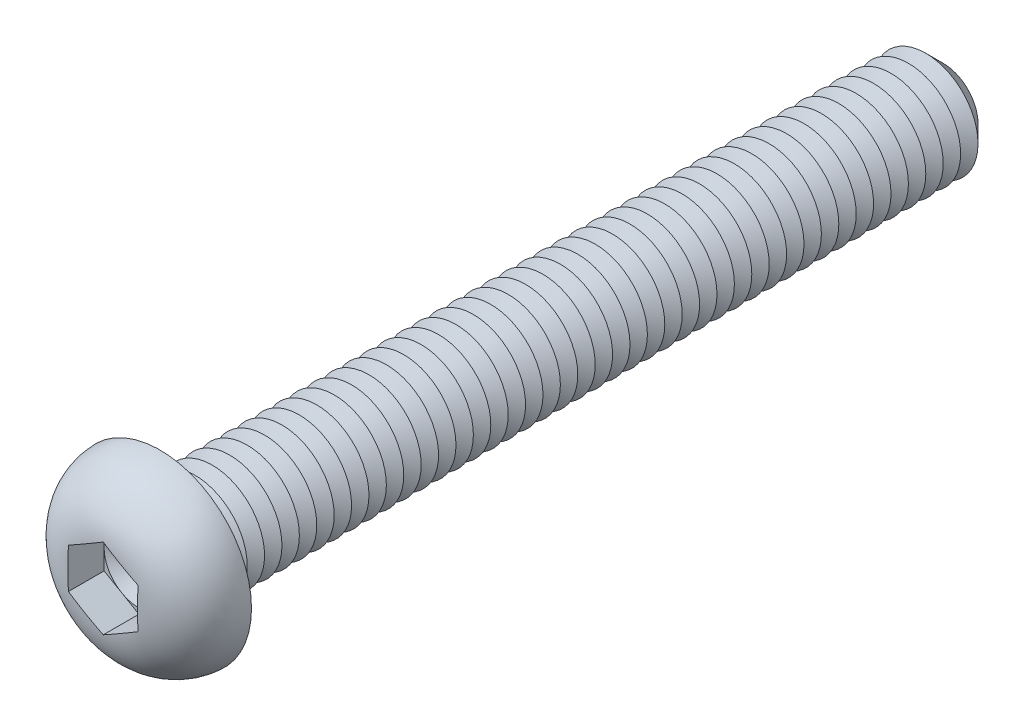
ISO-10303-21;
HEADER;
FILE_DESCRIPTION(('STEP AP214'),'2;1');
FILE_NAME('part.step','',(''),(''),'','','');
FILE_SCHEMA(('AUTOMOTIVE_DESIGN { 1 0 10303 214 1 1 1 1 }'));
ENDSEC;
DATA;
#1=APPLICATION_CONTEXT('core data for automotive mechanical design processes');
#2=APPLICATION_PROTOCOL_DEFINITION('international standard','automotive_design',2000,#1);
#3=PRODUCT_CONTEXT('',#1,'mechanical');
#4=PRODUCT('Part','Part','',(#3));
#5=PRODUCT_RELATED_PRODUCT_CATEGORY('part','',(#4));
#6=PRODUCT_DEFINITION_FORMATION('','',#4);
#7=PRODUCT_DEFINITION_CONTEXT('part definition',#1,'design');
#8=PRODUCT_DEFINITION('design','',#6,#7);
#9=PRODUCT_DEFINITION_SHAPE('','',#8);
#10=(LENGTH_UNIT() NAMED_UNIT(*) SI_UNIT(.MILLI.,.METRE.));
#11=(NAMED_UNIT(*) PLANE_ANGLE_UNIT() SI_UNIT($,.RADIAN.));
#12=(NAMED_UNIT(*) SI_UNIT($,.STERADIAN.) SOLID_ANGLE_UNIT());
#13=UNCERTAINTY_MEASURE_WITH_UNIT(LENGTH_MEASURE(1.E-05),#10,'distance_accuracy_value','');
#14=(GEOMETRIC_REPRESENTATION_CONTEXT(3) GLOBAL_UNCERTAINTY_ASSIGNED_CONTEXT((#13)) GLOBAL_UNIT_ASSIGNED_CONTEXT((#10,
#11,#12)) REPRESENTATION_CONTEXT('',''));
#15=CARTESIAN_POINT('',(0.,0.,0.));
#16=DIRECTION('',(0.,0.,1.));
#17=DIRECTION('',(1.,0.,0.));
#18=AXIS2_PLACEMENT_3D('',#15,#16,#17);
#19=CARTESIAN_POINT('',(0.,0.,1.22));
#20=DIRECTION('',(0.,0.,1.));
#21=DIRECTION('',(1.,0.,0.));
#22=AXIS2_PLACEMENT_3D('',#19,#20,#21);
#23=PLANE('',#22);
#24=CARTESIAN_POINT('',(0.,0.,1.22));
#25=DIRECTION('',(0.,0.,1.));
#26=DIRECTION('',(1.,0.,0.));
#27=AXIS2_PLACEMENT_3D('',#24,#25,#26);
#28=CIRCLE('',#27,2.);
#29=CARTESIAN_POINT('',(2.,0.,1.22));
#30=VERTEX_POINT('',#29);
#31=CARTESIAN_POINT('',(1.,1.73205080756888,1.22));
#32=VERTEX_POINT('',#31);
#33=EDGE_CURVE('E117',#30,#32,#28,.T.);
#34=ORIENTED_EDGE('',*,*,#33,.F.);
#35=DIRECTION('',(0.,1.,0.));
#36=VECTOR('',#35,1.);
#37=CARTESIAN_POINT('',(2.,-1.15470053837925,1.22));
#38=LINE('',#37,#36);
#39=CARTESIAN_POINT('',(2.,1.15470053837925,1.22));
#40=VERTEX_POINT('',#39);
#41=EDGE_CURVE('E140',#30,#40,#38,.T.);
#42=ORIENTED_EDGE('',*,*,#41,.T.);
#43=DIRECTION('',(-0.866025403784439,0.5,0.));
#44=VECTOR('',#43,1.);
#45=CARTESIAN_POINT('',(2.,1.15470053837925,1.22));
#46=LINE('',#45,#44);
#47=EDGE_CURVE('E136',#40,#32,#46,.T.);
#48=ORIENTED_EDGE('',*,*,#47,.T.);
#49=EDGE_LOOP('',(#34,#42,#48));
#50=FACE_BOUND('',#49,.T.);
#51=ADVANCED_FACE('F39',(#50),#23,.T.);
#52=CARTESIAN_POINT('',(0.,0.,1.22));
#53=DIRECTION('',(0.,0.,1.));
#54=DIRECTION('',(1.,0.,0.));
#55=AXIS2_PLACEMENT_3D('',#52,#53,#54);
#56=CIRCLE('',#55,2.);
#57=CARTESIAN_POINT('',(-1.,1.73205080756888,1.22));
#58=VERTEX_POINT('',#57);
#59=EDGE_CURVE('E11',#32,#58,#56,.T.);
#60=ORIENTED_EDGE('',*,*,#59,.F.);
#61=CARTESIAN_POINT('',(0.,2.3094010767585,1.22));
#62=VERTEX_POINT('',#61);
#63=EDGE_CURVE('E130',#32,#62,#46,.T.);
#64=ORIENTED_EDGE('',*,*,#63,.T.);
#65=DIRECTION('',(-0.866025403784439,-0.5,0.));
#66=VECTOR('',#65,1.);
#67=CARTESIAN_POINT('',(0.,2.3094010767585,1.22));
#68=LINE('',#67,#66);
#69=EDGE_CURVE('E131',#62,#58,#68,.T.);
#70=ORIENTED_EDGE('',*,*,#69,.T.);
#71=EDGE_LOOP('',(#60,#64,#70));
#72=FACE_BOUND('',#71,.T.);
#73=ADVANCED_FACE('F129',(#72),#23,.T.);
#74=CARTESIAN_POINT('',(-2.,0.,1.22));
#75=VERTEX_POINT('',#74);
#76=EDGE_CURVE('E49',#58,#75,#56,.T.);
#77=ORIENTED_EDGE('',*,*,#76,.F.);
#78=CARTESIAN_POINT('',(-2.,1.15470053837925,1.22));
#79=VERTEX_POINT('',#78);
#80=EDGE_CURVE('E143',#58,#79,#68,.T.);
#81=ORIENTED_EDGE('',*,*,#80,.T.);
#82=DIRECTION('',(0.,-1.,0.));
#83=VECTOR('',#82,1.);
#84=CARTESIAN_POINT('',(-2.,1.15470053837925,1.22));
#85=LINE('',#84,#83);
#86=EDGE_CURVE('E153',#79,#75,#85,.T.);
#87=ORIENTED_EDGE('',*,*,#86,.T.);
#88=EDGE_LOOP('',(#77,#81,#87));
#89=FACE_BOUND('',#88,.T.);
#90=ADVANCED_FACE('F270',(#89),#23,.T.);
#91=CARTESIAN_POINT('',(-1.,-1.73205080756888,1.22));
#92=VERTEX_POINT('',#91);
#93=EDGE_CURVE('E254',#75,#92,#56,.T.);
#94=ORIENTED_EDGE('',*,*,#93,.F.);
#95=CARTESIAN_POINT('',(-2.,-1.15470053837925,1.22));
#96=VERTEX_POINT('',#95);
#97=EDGE_CURVE('E152',#75,#96,#85,.T.);
#98=ORIENTED_EDGE('',*,*,#97,.T.);
#99=DIRECTION('',(0.866025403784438,-0.5,0.));
#100=VECTOR('',#99,1.);
#101=CARTESIAN_POINT('',(-2.,-1.15470053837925,1.22));
#102=LINE('',#101,#100);
#103=EDGE_CURVE('E158',#96,#92,#102,.T.);
#104=ORIENTED_EDGE('',*,*,#103,.T.);
#105=EDGE_LOOP('',(#94,#98,#104));
#106=FACE_BOUND('',#105,.T.);
#107=ADVANCED_FACE('F265',(#106),#23,.T.);
#108=CARTESIAN_POINT('',(0.999999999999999,-1.73205080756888,1.22));
#109=VERTEX_POINT('',#108);
#110=EDGE_CURVE('E56',#92,#109,#56,.T.);
#111=ORIENTED_EDGE('',*,*,#110,.F.);
#112=CARTESIAN_POINT('',(0.,-2.3094010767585,1.22));
#113=VERTEX_POINT('',#112);
#114=EDGE_CURVE('E157',#92,#113,#102,.T.);
#115=ORIENTED_EDGE('',*,*,#114,.T.);
#116=DIRECTION('',(0.866025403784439,0.5,0.));
#117=VECTOR('',#116,1.);
#118=CARTESIAN_POINT('',(0.,-2.3094010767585,1.22));
#119=LINE('',#118,#117);
#120=EDGE_CURVE('E163',#113,#109,#119,.T.);
#121=ORIENTED_EDGE('',*,*,#120,.T.);
#122=EDGE_LOOP('',(#111,#115,#121));
#123=FACE_BOUND('',#122,.T.);
#124=ADVANCED_FACE('F307',(#123),#23,.T.);
#125=CARTESIAN_POINT('',(0.,0.,-45.));
#126=DIRECTION('',(0.,0.,1.));
#127=DIRECTION('',(1.,0.,0.));
#128=AXIS2_PLACEMENT_3D('',#125,#126,#127);
#129=CYLINDRICAL_SURFACE('',#128,3.);
#130=CARTESIAN_POINT('',(0.,0.,-0.5));
#131=DIRECTION('',(0.,0.,1.));
#132=DIRECTION('',(1.,0.,0.));
#133=AXIS2_PLACEMENT_3D('',#130,#131,#132);
#134=CIRCLE('',#133,3.);
#135=CARTESIAN_POINT('',(3.,0.,-0.500000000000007));
#136=VERTEX_POINT('',#135);
#137=EDGE_CURVE('E242',#136,#136,#134,.F.);
#138=CARTESIAN_POINT('',(0.,0.,-1.));
#139=DIRECTION('',(0.,0.,1.));
#140=DIRECTION('',(1.,0.,0.));
#141=AXIS2_PLACEMENT_3D('',#138,#139,#140);
#142=CIRCLE('',#141,3.00000000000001);
#143=CARTESIAN_POINT('',(3.,0.,-1.00000000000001));
#144=VERTEX_POINT('',#143);
#145=EDGE_CURVE('E138',#144,#144,#142,.T.);
#146=CARTESIAN_POINT('',(3.,0.,-0.500000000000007));
#147=CARTESIAN_POINT('',(3.,0.,-0.50520833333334));
#148=CARTESIAN_POINT('',(3.,0.,-0.510416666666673));
#149=CARTESIAN_POINT('',(3.,0.,-0.520833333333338));
#150=CARTESIAN_POINT('',(3.,0.,-0.526041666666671));
#151=CARTESIAN_POINT('',(3.,0.,-0.536458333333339));
#152=CARTESIAN_POINT('',(3.,0.,-0.541666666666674));
#153=CARTESIAN_POINT('',(3.,0.,-0.552083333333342));
#154=CARTESIAN_POINT('',(3.,0.,-0.557291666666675));
#155=CARTESIAN_POINT('',(3.,0.,-0.56770833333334));
#156=CARTESIAN_POINT('',(3.,0.,-0.572916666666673));
#157=CARTESIAN_POINT('',(3.,0.,-0.583333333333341));
#158=CARTESIAN_POINT('',(3.,0.,-0.588541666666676));
#159=CARTESIAN_POINT('',(3.,0.,-0.598958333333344));
#160=CARTESIAN_POINT('',(3.,0.,-0.604166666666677));
#161=CARTESIAN_POINT('',(3.,0.,-0.614583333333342));
#162=CARTESIAN_POINT('',(3.,0.,-0.619791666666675));
#163=CARTESIAN_POINT('',(3.,0.,-0.63020833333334));
#164=CARTESIAN_POINT('',(3.,0.,-0.635416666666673));
#165=CARTESIAN_POINT('',(3.,0.,-0.645833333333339));
#166=CARTESIAN_POINT('',(3.,0.,-0.651041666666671));
#167=CARTESIAN_POINT('',(3.,0.,-0.661458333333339));
#168=CARTESIAN_POINT('',(3.,0.,-0.666666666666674));
#169=CARTESIAN_POINT('',(3.,0.,-0.677083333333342));
#170=CARTESIAN_POINT('',(3.,0.,-0.682291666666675));
#171=CARTESIAN_POINT('',(3.,0.,-0.69270833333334));
#172=CARTESIAN_POINT('',(3.,0.,-0.697916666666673));
#173=CARTESIAN_POINT('',(3.,0.,-0.708333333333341));
#174=CARTESIAN_POINT('',(3.,0.,-0.713541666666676));
#175=CARTESIAN_POINT('',(3.,0.,-0.723958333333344));
#176=CARTESIAN_POINT('',(3.,0.,-0.729166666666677));
#177=CARTESIAN_POINT('',(3.,0.,-0.739583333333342));
#178=CARTESIAN_POINT('',(3.,0.,-0.744791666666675));
#179=CARTESIAN_POINT('',(3.,0.,-0.75520833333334));
#180=CARTESIAN_POINT('',(3.,0.,-0.760416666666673));
#181=CARTESIAN_POINT('',(3.,0.,-0.770833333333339));
#182=CARTESIAN_POINT('',(3.,0.,-0.776041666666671));
#183=CARTESIAN_POINT('',(3.,0.,-0.786458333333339));
#184=CARTESIAN_POINT('',(3.,0.,-0.791666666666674));
#185=CARTESIAN_POINT('',(3.,0.,-0.802083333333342));
#186=CARTESIAN_POINT('',(3.,0.,-0.807291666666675));
#187=CARTESIAN_POINT('',(3.,0.,-0.81770833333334));
#188=CARTESIAN_POINT('',(3.,0.,-0.822916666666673));
#189=CARTESIAN_POINT('',(3.,0.,-0.833333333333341));
#190=CARTESIAN_POINT('',(3.,0.,-0.838541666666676));
#191=CARTESIAN_POINT('',(3.,0.,-0.848958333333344));
#192=CARTESIAN_POINT('',(3.,0.,-0.854166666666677));
#193=CARTESIAN_POINT('',(3.,0.,-0.864583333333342));
#194=CARTESIAN_POINT('',(3.,0.,-0.869791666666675));
#195=CARTESIAN_POINT('',(3.,0.,-0.88020833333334));
#196=CARTESIAN_POINT('',(3.,0.,-0.885416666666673));
#197=CARTESIAN_POINT('',(3.,0.,-0.895833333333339));
#198=CARTESIAN_POINT('',(3.,0.,-0.901041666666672));
#199=CARTESIAN_POINT('',(3.,0.,-0.911458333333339));
#200=CARTESIAN_POINT('',(3.,0.,-0.916666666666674));
#201=CARTESIAN_POINT('',(3.,0.,-0.927083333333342));
#202=CARTESIAN_POINT('',(3.,0.,-0.932291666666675));
#203=CARTESIAN_POINT('',(3.,0.,-0.942708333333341));
#204=CARTESIAN_POINT('',(3.,0.,-0.947916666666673));
#205=CARTESIAN_POINT('',(3.,0.,-0.958333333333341));
#206=CARTESIAN_POINT('',(3.,0.,-0.963541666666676));
#207=CARTESIAN_POINT('',(3.,0.,-0.973958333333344));
#208=CARTESIAN_POINT('',(3.,0.,-0.979166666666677));
#209=CARTESIAN_POINT('',(3.,0.,-0.989583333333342));
#210=CARTESIAN_POINT('',(3.,0.,-0.994791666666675));
#211=CARTESIAN_POINT('',(3.,0.,-1.00000000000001));
#212=B_SPLINE_CURVE_WITH_KNOTS('',3,(#146,#147,#148,#149,#150,#151,#152,#153,#154,#155,#156,
#157,#158,#159,#160,#161,#162,#163,#164,#165,#166,#167,#168,#169,#170,#171,#172,#173,#174,#175,
#176,#177,#178,#179,#180,#181,#182,#183,#184,#185,#186,#187,#188,#189,#190,#191,#192,#193,#194,
#195,#196,#197,#198,#199,#200,#201,#202,#203,#204,#205,#206,#207,#208,#209,#210,#211),
.UNSPECIFIED.,.F.,.F.,(4,2,2,2,2,2,2,2,2,2,2,2,2,2,2,2,2,2,2,2,2,2,2,2,2,2,2,2,2,2,2,2,4),(0.,
0.0156249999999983,0.0312499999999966,0.0468750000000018,0.0625000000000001,0.0781249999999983,
0.0937500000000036,0.109375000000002,0.125,0.140624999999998,0.156249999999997,
0.171875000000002,0.1875,0.203124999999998,0.218750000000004,0.234375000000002,0.25,
0.265624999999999,0.281249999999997,0.296875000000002,0.3125,0.328124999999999,
0.343750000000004,0.359375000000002,0.375,0.390624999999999,0.406249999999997,0.421875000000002,
0.4375,0.453124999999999,0.468750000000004,0.484375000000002,0.5),.UNSPECIFIED.);
#213=EDGE_CURVE('BSEAM308',#136,#144,#212,.T.);
#214=ORIENTED_EDGE('',*,*,#137,.T.);
#215=ORIENTED_EDGE('',*,*,#145,.T.);
#216=ORIENTED_EDGE('',*,*,#213,.T.);
#217=ORIENTED_EDGE('',*,*,#213,.F.);
#218=EDGE_LOOP('',(#214,#216,#215,#217));
#219=FACE_BOUND('',#218,.T.);
#220=ADVANCED_FACE('F308',(#219),#129,.T.);
#221=CARTESIAN_POINT('',(0.,5.25,0.));
#222=DIRECTION('',(0.,0.,1.));
#223=DIRECTION('',(1.,0.,0.));
#224=AXIS2_PLACEMENT_3D('',#221,#222,#223);
#225=PLANE('',#224);
#226=CARTESIAN_POINT('',(0.,0.,0.));
#227=DIRECTION('',(0.,0.,1.));
#228=DIRECTION('',(1.,0.,0.));
#229=AXIS2_PLACEMENT_3D('',#226,#227,#228);
#230=CIRCLE('',#229,3.5);
#231=CARTESIAN_POINT('',(3.5,0.,0.));
#232=VERTEX_POINT('',#231);
#233=EDGE_CURVE('E245',#232,#232,#230,.T.);
#234=ORIENTED_EDGE('',*,*,#233,.T.);
#235=EDGE_LOOP('',(#234));
#236=FACE_BOUND('',#235,.T.);
#237=CARTESIAN_POINT('',(0.,0.,0.));
#238=DIRECTION('',(0.,0.,1.));
#239=DIRECTION('',(1.,0.,0.));
#240=AXIS2_PLACEMENT_3D('',#237,#238,#239);
#241=CIRCLE('',#240,5.25);
#242=CARTESIAN_POINT('',(5.25,0.,0.));
#243=VERTEX_POINT('',#242);
#244=EDGE_CURVE('E174',#243,#243,#241,.T.);
#245=ORIENTED_EDGE('',*,*,#244,.F.);
#246=EDGE_LOOP('',(#245));
#247=FACE_BOUND('',#246,.T.);
#248=ADVANCED_FACE('F311',(#236,#247),#225,.F.);
#249=CARTESIAN_POINT('',(0.,0.,-0.0999999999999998));
#250=DIRECTION('',(0.,0.,1.));
#251=DIRECTION('',(1.,0.,0.));
#252=AXIS2_PLACEMENT_3D('',#249,#250,#251);
#253=DEGENERATE_TOROIDAL_SURFACE('',#252,1.85147090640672,3.4,.T.);
#254=CARTESIAN_POINT('',(-2.0002,1.15458506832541,3.26900492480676));
#255=CARTESIAN_POINT('',(-1.91694658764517,1.20265144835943,3.27552708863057));
#256=CARTESIAN_POINT('',(-1.83362001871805,1.25076006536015,3.28041849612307));
#257=CARTESIAN_POINT('',(-1.66691146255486,1.34700929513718,3.28784569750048));
#258=CARTESIAN_POINT('',(-1.58352950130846,1.39514989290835,3.29038223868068));
#259=CARTESIAN_POINT('',(-1.4167967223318,1.49141310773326,3.29400753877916));
#260=CARTESIAN_POINT('',(-1.33344591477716,1.5395357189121,3.29509714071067));
#261=CARTESIAN_POINT('',(-1.16673007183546,1.63578915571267,3.29647051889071));
#262=CARTESIAN_POINT('',(-1.08336503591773,1.68391998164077,3.29675420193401));
#263=CARTESIAN_POINT('',(-0.916634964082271,1.78018163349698,3.29675420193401));
#264=CARTESIAN_POINT('',(-0.833269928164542,1.82831245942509,3.29647051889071));
#265=CARTESIAN_POINT('',(-0.666554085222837,1.92456589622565,3.29509714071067));
#266=CARTESIAN_POINT('',(-0.583203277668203,1.9726885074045,3.29400753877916));
#267=CARTESIAN_POINT('',(-0.416470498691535,2.06895172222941,3.29038223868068));
#268=CARTESIAN_POINT('',(-0.333088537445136,2.11709232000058,3.28784569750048));
#269=CARTESIAN_POINT('',(-0.166379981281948,2.21334154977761,3.28041849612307));
#270=CARTESIAN_POINT('',(-0.0830534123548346,2.26145016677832,3.27552708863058));
#271=CARTESIAN_POINT('',(0.000200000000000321,2.30951654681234,3.26900492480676));
#272=B_SPLINE_CURVE_WITH_KNOTS('',3,(#254,#255,#256,#257,#258,#259,#260,#261,#262,#263,#264,
#265,#266,#267,#268,#269,#270,#271),.UNSPECIFIED.,.F.,.F.,(4,2,2,2,2,2,2,2,4),(0.,
0.289010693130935,0.57792963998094,0.866680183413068,1.15546411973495,1.44424805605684,
1.73299859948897,2.02191754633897,2.31092823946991),.UNSPECIFIED.);
#273=CARTESIAN_POINT('',(-2.,1.15470053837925,3.26902062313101));
#274=VERTEX_POINT('',#273);
#275=CARTESIAN_POINT('',(1.70733705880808E-11,2.30940107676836,3.2690206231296));
#276=VERTEX_POINT('',#275);
#277=EDGE_CURVE('E196',#274,#276,#272,.T.);
#278=ORIENTED_EDGE('',*,*,#277,.T.);
#279=CARTESIAN_POINT('',(-0.000199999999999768,2.30951654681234,3.26900492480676));
#280=CARTESIAN_POINT('',(0.0830534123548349,2.26145016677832,3.27552708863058));
#281=CARTESIAN_POINT('',(0.166379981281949,2.21334154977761,3.28041849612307));
#282=CARTESIAN_POINT('',(0.333088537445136,2.11709232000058,3.28784569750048));
#283=CARTESIAN_POINT('',(0.416470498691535,2.06895172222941,3.29038223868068));
#284=CARTESIAN_POINT('',(0.583203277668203,1.9726885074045,3.29400753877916));
#285=CARTESIAN_POINT('',(0.666554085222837,1.92456589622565,3.29509714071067));
#286=CARTESIAN_POINT('',(0.833269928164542,1.82831245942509,3.29647051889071));
#287=CARTESIAN_POINT('',(0.916634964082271,1.78018163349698,3.29675420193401));
#288=CARTESIAN_POINT('',(1.08336503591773,1.68391998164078,3.29675420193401));
#289=CARTESIAN_POINT('',(1.16673007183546,1.63578915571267,3.29647051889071));
#290=CARTESIAN_POINT('',(1.33344591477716,1.5395357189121,3.29509714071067));
#291=CARTESIAN_POINT('',(1.4167967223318,1.49141310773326,3.29400753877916));
#292=CARTESIAN_POINT('',(1.58352950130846,1.39514989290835,3.29038223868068));
#293=CARTESIAN_POINT('',(1.66691146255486,1.34700929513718,3.28784569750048));
#294=CARTESIAN_POINT('',(1.83362001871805,1.25076006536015,3.28041849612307));
#295=CARTESIAN_POINT('',(1.91694658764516,1.20265144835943,3.27552708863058));
#296=CARTESIAN_POINT('',(2.0002,1.15458506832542,3.26900492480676));
#297=B_SPLINE_CURVE_WITH_KNOTS('',3,(#279,#280,#281,#282,#283,#284,#285,#286,#287,#288,#289,
#290,#291,#292,#293,#294,#295,#296),.UNSPECIFIED.,.F.,.F.,(4,2,2,2,2,2,2,2,4),(0.,
0.289010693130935,0.577929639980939,0.866680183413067,1.15546411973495,1.44424805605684,
1.73299859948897,2.02191754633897,2.31092823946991),.UNSPECIFIED.);
#298=CARTESIAN_POINT('',(2.,1.15470053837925,3.26902062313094));
#299=VERTEX_POINT('',#298);
#300=EDGE_CURVE('E225',#276,#299,#297,.T.);
#301=ORIENTED_EDGE('',*,*,#300,.T.);
#302=CARTESIAN_POINT('',(2.,0.,3.29675420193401));
#303=CARTESIAN_POINT('',(2.,-0.0838690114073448,3.29675159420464));
#304=CARTESIAN_POINT('',(2.,-0.167737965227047,3.29653427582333));
#305=CARTESIAN_POINT('',(2.,-0.335473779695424,3.29552217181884));
#306=CARTESIAN_POINT('',(2.,-0.419340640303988,3.29472737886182));
#307=CARTESIAN_POINT('',(2.,-0.587092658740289,3.29218243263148));
#308=CARTESIAN_POINT('',(2.,-0.670977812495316,3.29043194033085));
#309=CARTESIAN_POINT('',(2.,-0.838702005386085,3.28542814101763));
#310=CARTESIAN_POINT('',(2.,-0.922541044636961,3.28217483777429));
#311=CARTESIAN_POINT('',(2.,-1.173343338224,3.26923984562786));
#312=CARTESIAN_POINT('',(2.,-1.34017699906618,3.25638268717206));
#313=CARTESIAN_POINT('',(2.,-1.67225876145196,3.21731215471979));
#314=CARTESIAN_POINT('',(2.,-1.83750825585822,3.19111187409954));
#315=CARTESIAN_POINT('',(2.,-2.10571503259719,3.13417573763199));
#316=CARTESIAN_POINT('',(2.,-2.20973442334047,3.10844622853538));
#317=CARTESIAN_POINT('',(2.,-2.41562153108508,3.04936015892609));
#318=CARTESIAN_POINT('',(2.,-2.51748898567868,3.01600267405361));
#319=CARTESIAN_POINT('',(2.,-2.71832295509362,2.94120377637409));
#320=CARTESIAN_POINT('',(2.,-2.81728700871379,2.89975572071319));
#321=CARTESIAN_POINT('',(2.,-3.01134256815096,2.80859624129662));
#322=CARTESIAN_POINT('',(2.,-3.10643425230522,2.75888519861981));
#323=CARTESIAN_POINT('',(2.,-3.29253530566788,2.65079509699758));
#324=CARTESIAN_POINT('',(2.,-3.38350832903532,2.59235327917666));
#325=CARTESIAN_POINT('',(2.,-3.55964478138,2.46728791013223));
#326=CARTESIAN_POINT('',(2.,-3.64480873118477,2.40066509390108));
#327=CARTESIAN_POINT('',(2.,-3.80840353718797,2.25961603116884));
#328=CARTESIAN_POINT('',(2.,-3.88683504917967,2.18519054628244));
#329=CARTESIAN_POINT('',(2.,-4.03608847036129,2.02906828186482));
#330=CARTESIAN_POINT('',(2.,-4.106911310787,1.94737239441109));
#331=CARTESIAN_POINT('',(2.,-4.23287471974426,1.78665318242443));
#332=CARTESIAN_POINT('',(2.,-4.2888832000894,1.7083085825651));
#333=CARTESIAN_POINT('',(2.,-4.39372062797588,1.54691061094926));
#334=CARTESIAN_POINT('',(2.,-4.44254705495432,1.46385560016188));
#335=CARTESIAN_POINT('',(2.,-4.53249771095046,1.29375158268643));
#336=CARTESIAN_POINT('',(2.,-4.57362814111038,1.20670586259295));
#337=CARTESIAN_POINT('',(2.,-4.6478549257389,1.02924414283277));
#338=CARTESIAN_POINT('',(2.,-4.68094842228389,0.938826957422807));
#339=CARTESIAN_POINT('',(2.,-4.76413649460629,0.674747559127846));
#340=CARTESIAN_POINT('',(2.,-4.80368573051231,0.497625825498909));
#341=CARTESIAN_POINT('',(2.,-4.85179982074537,0.13932226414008));
#342=CARTESIAN_POINT('',(2.,-4.86036774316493,-0.0418591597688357));
#343=CARTESIAN_POINT('',(2.,-4.84642577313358,-0.399473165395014));
#344=CARTESIAN_POINT('',(2.,-4.82452156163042,-0.575929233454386));
#345=CARTESIAN_POINT('',(2.,-4.75142809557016,-0.922615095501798));
#346=CARTESIAN_POINT('',(2.,-4.70024536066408,-1.09284626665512));
#347=CARTESIAN_POINT('',(2.,-4.57020203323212,-1.42258491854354));
#348=CARTESIAN_POINT('',(2.,-4.49131097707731,-1.58208036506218));
#349=CARTESIAN_POINT('',(2.,-4.3083542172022,-1.8860021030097));
#350=CARTESIAN_POINT('',(2.,-4.2042742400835,-2.03041978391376));
#351=CARTESIAN_POINT('',(2.,-3.97174533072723,-2.30354399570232));
#352=CARTESIAN_POINT('',(2.,-3.84281347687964,-2.43183812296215));
#353=CARTESIAN_POINT('',(2.,-3.56631740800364,-2.66612298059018));
#354=CARTESIAN_POINT('',(2.,-3.41877418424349,-2.77213848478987));
#355=CARTESIAN_POINT('',(2.,-3.18261597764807,-2.91604941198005));
#356=CARTESIAN_POINT('',(2.,-3.09905663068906,-2.96247915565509));
#357=CARTESIAN_POINT('',(2.,-2.92856838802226,-3.04879370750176));
#358=CARTESIAN_POINT('',(2.,-2.84163827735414,-3.08867612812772));
#359=CARTESIAN_POINT('',(2.,-2.66495003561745,-3.16199567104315));
#360=CARTESIAN_POINT('',(2.,-2.57518752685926,-3.19542218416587));
#361=CARTESIAN_POINT('',(2.,-2.3936698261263,-3.25594506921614));
#362=CARTESIAN_POINT('',(2.,-2.30191676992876,-3.28304789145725));
#363=CARTESIAN_POINT('',(2.,-2.07265810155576,-3.34285611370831));
#364=CARTESIAN_POINT('',(2.,-1.93423373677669,-3.37205334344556));
#365=CARTESIAN_POINT('',(2.,-1.65546420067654,-3.419280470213));
#366=CARTESIAN_POINT('',(2.,-1.51511762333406,-3.43730169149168));
#367=CARTESIAN_POINT('',(2.,-1.23291689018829,-3.46473877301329));
#368=CARTESIAN_POINT('',(2.,-1.09105869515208,-3.47411015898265));
#369=CARTESIAN_POINT('',(2.,-0.807138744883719,-3.48717303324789));
#370=CARTESIAN_POINT('',(2.,-0.665077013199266,-3.4908651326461));
#371=CARTESIAN_POINT('',(2.,-0.451303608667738,-3.49429675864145));
#372=CARTESIAN_POINT('',(2.,-0.379602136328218,-3.49508825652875));
#373=CARTESIAN_POINT('',(2.,-0.236195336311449,-3.49619580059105));
#374=CARTESIAN_POINT('',(2.,-0.164490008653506,-3.49651184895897));
#375=CARTESIAN_POINT('',(2.,-0.0210718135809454,-3.49680708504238));
#376=CARTESIAN_POINT('',(2.,0.0506410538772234,-3.49678623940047));
#377=CARTESIAN_POINT('',(2.,0.194065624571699,-3.49639104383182));
#378=CARTESIAN_POINT('',(2.,0.265777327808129,-3.49601669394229));
#379=CARTESIAN_POINT('',(2.,0.480501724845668,-3.4941697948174));
#380=CARTESIAN_POINT('',(2.,0.623510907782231,-3.49197539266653));
#381=CARTESIAN_POINT('',(2.,0.909378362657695,-3.48318258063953));
#382=CARTESIAN_POINT('',(2.,1.05223667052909,-3.47658576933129));
#383=CARTESIAN_POINT('',(2.,1.30726724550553,-3.45800282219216));
#384=CARTESIAN_POINT('',(2.,1.41953767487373,-3.44745204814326));
#385=CARTESIAN_POINT('',(2.,1.64336701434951,-3.42020385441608));
#386=CARTESIAN_POINT('',(2.,1.75492585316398,-3.40350582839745));
#387=CARTESIAN_POINT('',(2.,1.97590795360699,-3.36293007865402));
#388=CARTESIAN_POINT('',(2.,2.08534088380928,-3.33910600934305));
#389=CARTESIAN_POINT('',(2.,2.30216001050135,-3.28336687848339));
#390=CARTESIAN_POINT('',(2.,2.40954602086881,-3.25145108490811));
#391=CARTESIAN_POINT('',(2.,2.62289868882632,-3.1784271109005));
#392=CARTESIAN_POINT('',(2.,2.72882262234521,-3.13719314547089));
#393=CARTESIAN_POINT('',(2.,2.93660837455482,-3.04548652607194));
#394=CARTESIAN_POINT('',(2.,3.03847031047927,-2.99501413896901));
#395=CARTESIAN_POINT('',(2.,3.23738754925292,-2.88459171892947));
#396=CARTESIAN_POINT('',(2.,3.33442546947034,-2.82461027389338));
#397=CARTESIAN_POINT('',(2.,3.52225616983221,-2.69545434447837));
#398=CARTESIAN_POINT('',(2.,3.61304636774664,-2.62627609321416));
#399=CARTESIAN_POINT('',(2.,3.77958578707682,-2.48563135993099));
#400=CARTESIAN_POINT('',(2.,3.85595570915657,-2.41489922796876));
#401=CARTESIAN_POINT('',(2.,4.00175744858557,-2.26661746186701));
#402=CARTESIAN_POINT('',(2.,4.07118992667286,-2.18906847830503));
#403=CARTESIAN_POINT('',(2.,4.20228235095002,-2.02784942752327));
#404=CARTESIAN_POINT('',(2.,4.26395450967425,-1.94418931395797));
#405=CARTESIAN_POINT('',(2.,4.37897455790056,-1.7713710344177));
#406=CARTESIAN_POINT('',(2.,4.43232318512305,-1.68221335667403));
#407=CARTESIAN_POINT('',(2.,4.5685109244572,-1.42722170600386));
#408=CARTESIAN_POINT('',(2.,4.64167742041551,-1.25607726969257));
#409=CARTESIAN_POINT('',(2.,4.75695354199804,-0.903699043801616));
#410=CARTESIAN_POINT('',(2.,4.79906366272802,-0.722465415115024));
#411=CARTESIAN_POINT('',(2.,4.84982785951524,-0.362243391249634));
#412=CARTESIAN_POINT('',(2.,4.85966759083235,-0.183422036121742));
#413=CARTESIAN_POINT('',(2.,4.84889099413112,0.17327689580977));
#414=CARTESIAN_POINT('',(2.,4.82827907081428,0.351154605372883));
#415=CARTESIAN_POINT('',(2.,4.75760776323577,0.699332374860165));
#416=CARTESIAN_POINT('',(2.,4.70780624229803,0.869684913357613));
#417=CARTESIAN_POINT('',(2.,4.58058971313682,1.199716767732));
#418=CARTESIAN_POINT('',(2.,4.50317623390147,1.35939667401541));
#419=CARTESIAN_POINT('',(2.,4.32230037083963,1.66542907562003));
#420=CARTESIAN_POINT('',(2.,4.21858077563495,1.81162931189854));
#421=CARTESIAN_POINT('',(2.,3.98879583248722,2.08527000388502));
#422=CARTESIAN_POINT('',(2.,3.86272429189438,2.21270524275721));
#423=CARTESIAN_POINT('',(2.,3.58743550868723,2.45020985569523));
#424=CARTESIAN_POINT('',(2.,3.43756474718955,2.55951924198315));
#425=CARTESIAN_POINT('',(2.,3.12282273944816,2.7535430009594));
#426=CARTESIAN_POINT('',(2.,2.95795742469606,2.83826704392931));
#427=CARTESIAN_POINT('',(2.,2.67096435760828,2.96064273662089));
#428=CARTESIAN_POINT('',(2.,2.55150855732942,3.00473766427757));
#429=CARTESIAN_POINT('',(2.,2.30905936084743,3.08191633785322));
#430=CARTESIAN_POINT('',(2.,2.18606487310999,3.11499664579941));
#431=CARTESIAN_POINT('',(2.,1.93761764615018,3.17114962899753));
#432=CARTESIAN_POINT('',(2.,1.8121607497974,3.19420352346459));
#433=CARTESIAN_POINT('',(2.,1.56000755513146,3.23170431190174));
#434=CARTESIAN_POINT('',(2.,1.43331126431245,3.24615125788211));
#435=CARTESIAN_POINT('',(2.,1.19785080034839,3.26676473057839));
#436=CARTESIAN_POINT('',(2.,1.08915974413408,3.27383022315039));
#437=CARTESIAN_POINT('',(2.,0.87159878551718,3.28448481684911));
#438=CARTESIAN_POINT('',(2.,0.762728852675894,3.28807324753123));
#439=CARTESIAN_POINT('',(2.,0.54488171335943,3.29312180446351));
#440=CARTESIAN_POINT('',(2.,0.435904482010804,3.29458062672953));
#441=CARTESIAN_POINT('',(2.,0.217951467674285,3.29639847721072));
#442=CARTESIAN_POINT('',(2.,0.108975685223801,3.29675759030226));
#443=CARTESIAN_POINT('',(2.,0.,3.29675420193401));
#444=B_SPLINE_CURVE_WITH_KNOTS('',3,(#302,#303,#304,#305,#306,#307,#308,#309,#310,#311,#312,
#313,#314,#315,#316,#317,#318,#319,#320,#321,#322,#323,#324,#325,#326,#327,#328,#329,#330,#331,
#332,#333,#334,#335,#336,#337,#338,#339,#340,#341,#342,#343,#344,#345,#346,#347,#348,#349,#350,
#351,#352,#353,#354,#355,#356,#357,#358,#359,#360,#361,#362,#363,#364,#365,#366,#367,#368,#369,
#370,#371,#372,#373,#374,#375,#376,#377,#378,#379,#380,#381,#382,#383,#384,#385,#386,#387,#388,
#389,#390,#391,#392,#393,#394,#395,#396,#397,#398,#399,#400,#401,#402,#403,#404,#405,#406,#407,
#408,#409,#410,#411,#412,#413,#414,#415,#416,#417,#418,#419,#420,#421,#422,#423,#424,#425,#426,
#427,#428,#429,#430,#431,#432,#433,#434,#435,#436,#437,#438,#439,#440,#441,#442,#443),
.UNSPECIFIED.,.T.,.F.,(4,2,2,2,2,2,2,2,2,2,2,2,2,2,2,2,2,2,2,2,2,2,2,2,2,2,2,2,2,2,2,2,2,2,2,2,
2,2,2,2,2,2,2,2,2,2,2,2,2,2,2,2,2,2,2,2,2,2,2,2,2,2,2,2,2,2,2,2,2,2,4),(0.,0.251606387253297,
0.503215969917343,0.754914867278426,1.00661313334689,1.50825543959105,2.00940643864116,
2.33061510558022,2.65186271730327,2.97337521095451,3.29487288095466,3.61880390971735,
3.94270585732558,4.26657621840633,4.59040689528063,4.8789527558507,5.16759964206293,
5.45601293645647,5.74452864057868,6.28608750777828,6.82759274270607,7.35848716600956,
7.8892634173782,8.42062506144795,8.95228851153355,9.49557283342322,10.0382497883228,
10.3247866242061,10.6114277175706,10.8985359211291,11.1853499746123,11.6091713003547,
12.0333212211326,12.4596400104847,12.8859129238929,13.1010304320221,13.316146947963,
13.5312847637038,13.746422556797,14.1754765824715,14.6043748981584,14.9425387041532,
15.2807358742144,15.6164481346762,15.9521907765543,16.2927694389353,16.6333382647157,
16.9750565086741,17.3169151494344,17.6287548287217,17.9405647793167,18.2518777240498,
18.5631630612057,19.1185081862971,19.6738444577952,20.20853386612,20.7431459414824,
21.2731049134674,21.8030345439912,22.3383600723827,22.8738341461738,23.4279697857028,
23.9818871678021,24.3633752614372,24.7449823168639,25.1273011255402,25.5096176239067,
25.8363061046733,26.163057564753,26.4900090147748,26.8169352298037),.UNSPECIFIED.);
#445=CARTESIAN_POINT('',(2.,-1.15470053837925,3.26902062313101));
#446=VERTEX_POINT('',#445);
#447=EDGE_CURVE('E234',#299,#446,#444,.T.);
#448=ORIENTED_EDGE('',*,*,#447,.T.);
#449=CARTESIAN_POINT('',(2.0002,-1.15458506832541,3.26900492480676));
#450=CARTESIAN_POINT('',(1.91694658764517,-1.20265144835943,3.27552708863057));
#451=CARTESIAN_POINT('',(1.83362001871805,-1.25076006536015,3.28041849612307));
#452=CARTESIAN_POINT('',(1.66691146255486,-1.34700929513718,3.28784569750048));
#453=CARTESIAN_POINT('',(1.58352950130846,-1.39514989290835,3.29038223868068));
#454=CARTESIAN_POINT('',(1.4167967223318,-1.49141310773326,3.29400753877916));
#455=CARTESIAN_POINT('',(1.33344591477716,-1.5395357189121,3.29509714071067));
#456=CARTESIAN_POINT('',(1.16673007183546,-1.63578915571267,3.29647051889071));
#457=CARTESIAN_POINT('',(1.08336503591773,-1.68391998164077,3.29675420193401));
#458=CARTESIAN_POINT('',(0.916634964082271,-1.78018163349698,3.29675420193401));
#459=CARTESIAN_POINT('',(0.833269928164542,-1.82831245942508,3.29647051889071));
#460=CARTESIAN_POINT('',(0.666554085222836,-1.92456589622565,3.29509714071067));
#461=CARTESIAN_POINT('',(0.583203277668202,-1.97268850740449,3.29400753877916));
#462=CARTESIAN_POINT('',(0.416470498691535,-2.06895172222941,3.29038223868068));
#463=CARTESIAN_POINT('',(0.333088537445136,-2.11709232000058,3.28784569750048));
#464=CARTESIAN_POINT('',(0.166379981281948,-2.2133415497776,3.28041849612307));
#465=CARTESIAN_POINT('',(0.0830534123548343,-2.26145016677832,3.27552708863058));
#466=CARTESIAN_POINT('',(-0.000200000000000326,-2.30951654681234,3.26900492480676));
#467=B_SPLINE_CURVE_WITH_KNOTS('',3,(#449,#450,#451,#452,#453,#454,#455,#456,#457,#458,#459,
#460,#461,#462,#463,#464,#465,#466),.UNSPECIFIED.,.F.,.F.,(4,2,2,2,2,2,2,2,4),(0.,
0.289010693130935,0.57792963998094,0.866680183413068,1.15546411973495,1.44424805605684,
1.73299859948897,2.02191754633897,2.31092823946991),.UNSPECIFIED.);
#468=CARTESIAN_POINT('',(0.,-2.3094010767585,3.26902062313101));
#469=VERTEX_POINT('',#468);
#470=EDGE_CURVE('E281',#446,#469,#467,.T.);
#471=ORIENTED_EDGE('',*,*,#470,.T.);
#472=CARTESIAN_POINT('',(0.000199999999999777,-2.30951654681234,3.26900492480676));
#473=CARTESIAN_POINT('',(-0.083053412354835,-2.26145016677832,3.27552708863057));
#474=CARTESIAN_POINT('',(-0.166379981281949,-2.21334154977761,3.28041849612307));
#475=CARTESIAN_POINT('',(-0.333088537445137,-2.11709232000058,3.28784569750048));
#476=CARTESIAN_POINT('',(-0.416470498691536,-2.06895172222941,3.29038223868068));
#477=CARTESIAN_POINT('',(-0.583203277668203,-1.97268850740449,3.29400753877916));
#478=CARTESIAN_POINT('',(-0.666554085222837,-1.92456589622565,3.29509714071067));
#479=CARTESIAN_POINT('',(-0.833269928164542,-1.82831245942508,3.29647051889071));
#480=CARTESIAN_POINT('',(-0.916634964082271,-1.78018163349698,3.29675420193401));
#481=CARTESIAN_POINT('',(-1.08336503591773,-1.68391998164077,3.29675420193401));
#482=CARTESIAN_POINT('',(-1.16673007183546,-1.63578915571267,3.29647051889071));
#483=CARTESIAN_POINT('',(-1.33344591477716,-1.5395357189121,3.29509714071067));
#484=CARTESIAN_POINT('',(-1.4167967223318,-1.49141310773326,3.29400753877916));
#485=CARTESIAN_POINT('',(-1.58352950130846,-1.39514989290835,3.29038223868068));
#486=CARTESIAN_POINT('',(-1.66691146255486,-1.34700929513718,3.28784569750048));
#487=CARTESIAN_POINT('',(-1.83362001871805,-1.25076006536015,3.28041849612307));
#488=CARTESIAN_POINT('',(-1.91694658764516,-1.20265144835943,3.27552708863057));
#489=CARTESIAN_POINT('',(-2.0002,-1.15458506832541,3.26900492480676));
#490=B_SPLINE_CURVE_WITH_KNOTS('',3,(#472,#473,#474,#475,#476,#477,#478,#479,#480,#481,#482,
#483,#484,#485,#486,#487,#488,#489),.UNSPECIFIED.,.F.,.F.,(4,2,2,2,2,2,2,2,4),(0.,
0.289010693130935,0.577929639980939,0.866680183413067,1.15546411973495,1.44424805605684,
1.73299859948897,2.02191754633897,2.31092823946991),.UNSPECIFIED.);
#491=CARTESIAN_POINT('',(-2.,-1.15470053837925,3.26902062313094));
#492=VERTEX_POINT('',#491);
#493=EDGE_CURVE('E277',#469,#492,#490,.T.);
#494=ORIENTED_EDGE('',*,*,#493,.T.);
#495=CARTESIAN_POINT('',(-2.,0.,3.29675420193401));
#496=CARTESIAN_POINT('',(-2.,0.0838690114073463,3.29675159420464));
#497=CARTESIAN_POINT('',(-2.,0.167737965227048,3.29653427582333));
#498=CARTESIAN_POINT('',(-2.,0.335473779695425,3.29552217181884));
#499=CARTESIAN_POINT('',(-2.,0.41934064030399,3.29472737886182));
#500=CARTESIAN_POINT('',(-2.,0.58709265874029,3.29218243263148));
#501=CARTESIAN_POINT('',(-2.,0.670977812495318,3.29043194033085));
#502=CARTESIAN_POINT('',(-2.,0.838702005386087,3.28542814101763));
#503=CARTESIAN_POINT('',(-2.,0.922541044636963,3.28217483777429));
#504=CARTESIAN_POINT('',(-2.,1.173343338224,3.26923984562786));
#505=CARTESIAN_POINT('',(-2.,1.34017699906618,3.25638268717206));
#506=CARTESIAN_POINT('',(-2.,1.67225876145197,3.21731215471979));
#507=CARTESIAN_POINT('',(-2.,1.83750825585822,3.19111187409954));
#508=CARTESIAN_POINT('',(-2.,2.10571503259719,3.13417573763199));
#509=CARTESIAN_POINT('',(-2.,2.20973442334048,3.10844622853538));
#510=CARTESIAN_POINT('',(-2.,2.41562153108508,3.04936015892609));
#511=CARTESIAN_POINT('',(-2.,2.51748898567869,3.01600267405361));
#512=CARTESIAN_POINT('',(-2.,2.71832295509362,2.94120377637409));
#513=CARTESIAN_POINT('',(-2.,2.81728700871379,2.89975572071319));
#514=CARTESIAN_POINT('',(-2.,3.01134256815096,2.80859624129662));
#515=CARTESIAN_POINT('',(-2.,3.10643425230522,2.75888519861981));
#516=CARTESIAN_POINT('',(-2.,3.29253530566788,2.65079509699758));
#517=CARTESIAN_POINT('',(-2.,3.38350832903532,2.59235327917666));
#518=CARTESIAN_POINT('',(-2.,3.55964478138,2.46728791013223));
#519=CARTESIAN_POINT('',(-2.,3.64480873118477,2.40066509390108));
#520=CARTESIAN_POINT('',(-2.,3.80840353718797,2.25961603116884));
#521=CARTESIAN_POINT('',(-2.,3.88683504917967,2.18519054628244));
#522=CARTESIAN_POINT('',(-2.,4.03608847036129,2.02906828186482));
#523=CARTESIAN_POINT('',(-2.,4.106911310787,1.94737239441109));
#524=CARTESIAN_POINT('',(-2.,4.23287471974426,1.78665318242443));
#525=CARTESIAN_POINT('',(-2.,4.2888832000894,1.7083085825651));
#526=CARTESIAN_POINT('',(-2.,4.39372062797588,1.54691061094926));
#527=CARTESIAN_POINT('',(-2.,4.44254705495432,1.46385560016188));
#528=CARTESIAN_POINT('',(-2.,4.53249771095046,1.29375158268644));
#529=CARTESIAN_POINT('',(-2.,4.57362814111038,1.20670586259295));
#530=CARTESIAN_POINT('',(-2.,4.6478549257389,1.02924414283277));
#531=CARTESIAN_POINT('',(-2.,4.68094842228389,0.938826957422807));
#532=CARTESIAN_POINT('',(-2.,4.76413649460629,0.674747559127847));
#533=CARTESIAN_POINT('',(-2.,4.80368573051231,0.497625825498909));
#534=CARTESIAN_POINT('',(-2.,4.85179982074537,0.13932226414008));
#535=CARTESIAN_POINT('',(-2.,4.86036774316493,-0.0418591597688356));
#536=CARTESIAN_POINT('',(-2.,4.84642577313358,-0.399473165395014));
#537=CARTESIAN_POINT('',(-2.,4.82452156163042,-0.575929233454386));
#538=CARTESIAN_POINT('',(-2.,4.75142809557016,-0.922615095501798));
#539=CARTESIAN_POINT('',(-2.,4.70024536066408,-1.09284626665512));
#540=CARTESIAN_POINT('',(-2.,4.57020203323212,-1.42258491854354));
#541=CARTESIAN_POINT('',(-2.,4.49131097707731,-1.58208036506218));
#542=CARTESIAN_POINT('',(-2.,4.3083542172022,-1.8860021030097));
#543=CARTESIAN_POINT('',(-2.,4.2042742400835,-2.03041978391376));
#544=CARTESIAN_POINT('',(-2.,3.97174533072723,-2.30354399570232));
#545=CARTESIAN_POINT('',(-2.,3.84281347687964,-2.43183812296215));
#546=CARTESIAN_POINT('',(-2.,3.56631740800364,-2.66612298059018));
#547=CARTESIAN_POINT('',(-2.,3.41877418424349,-2.77213848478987));
#548=CARTESIAN_POINT('',(-2.,3.18261597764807,-2.91604941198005));
#549=CARTESIAN_POINT('',(-2.,3.09905663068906,-2.96247915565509));
#550=CARTESIAN_POINT('',(-2.,2.92856838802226,-3.04879370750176));
#551=CARTESIAN_POINT('',(-2.,2.84163827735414,-3.08867612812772));
#552=CARTESIAN_POINT('',(-2.,2.66495003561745,-3.16199567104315));
#553=CARTESIAN_POINT('',(-2.,2.57518752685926,-3.19542218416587));
#554=CARTESIAN_POINT('',(-2.,2.3936698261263,-3.25594506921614));
#555=CARTESIAN_POINT('',(-2.,2.30191676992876,-3.28304789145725));
#556=CARTESIAN_POINT('',(-2.,2.07265810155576,-3.34285611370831));
#557=CARTESIAN_POINT('',(-2.,1.93423373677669,-3.37205334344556));
#558=CARTESIAN_POINT('',(-2.,1.65546420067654,-3.419280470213));
#559=CARTESIAN_POINT('',(-2.,1.51511762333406,-3.43730169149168));
#560=CARTESIAN_POINT('',(-2.,1.23291689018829,-3.46473877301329));
#561=CARTESIAN_POINT('',(-2.,1.09105869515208,-3.47411015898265));
#562=CARTESIAN_POINT('',(-2.,0.807138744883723,-3.48717303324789));
#563=CARTESIAN_POINT('',(-2.,0.66507701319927,-3.4908651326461));
#564=CARTESIAN_POINT('',(-2.,0.451303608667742,-3.49429675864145));
#565=CARTESIAN_POINT('',(-2.,0.379602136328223,-3.49508825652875));
#566=CARTESIAN_POINT('',(-2.,0.236195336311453,-3.49619580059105));
#567=CARTESIAN_POINT('',(-2.,0.16449000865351,-3.49651184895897));
#568=CARTESIAN_POINT('',(-2.,0.0210718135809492,-3.49680708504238));
#569=CARTESIAN_POINT('',(-2.,-0.0506410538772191,-3.49678623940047));
#570=CARTESIAN_POINT('',(-2.,-0.194065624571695,-3.49639104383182));
#571=CARTESIAN_POINT('',(-2.,-0.265777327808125,-3.49601669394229));
#572=CARTESIAN_POINT('',(-2.,-0.480501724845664,-3.4941697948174));
#573=CARTESIAN_POINT('',(-2.,-0.623510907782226,-3.49197539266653));
#574=CARTESIAN_POINT('',(-2.,-0.909378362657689,-3.48318258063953));
#575=CARTESIAN_POINT('',(-2.,-1.05223667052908,-3.47658576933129));
#576=CARTESIAN_POINT('',(-2.,-1.30726724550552,-3.45800282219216));
#577=CARTESIAN_POINT('',(-2.,-1.41953767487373,-3.44745204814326));
#578=CARTESIAN_POINT('',(-2.,-1.6433670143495,-3.42020385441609));
#579=CARTESIAN_POINT('',(-2.,-1.75492585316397,-3.40350582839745));
#580=CARTESIAN_POINT('',(-2.,-1.97590795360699,-3.36293007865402));
#581=CARTESIAN_POINT('',(-2.,-2.08534088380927,-3.33910600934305));
#582=CARTESIAN_POINT('',(-2.,-2.30216001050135,-3.28336687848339));
#583=CARTESIAN_POINT('',(-2.,-2.4095460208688,-3.25145108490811));
#584=CARTESIAN_POINT('',(-2.,-2.62289868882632,-3.1784271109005));
#585=CARTESIAN_POINT('',(-2.,-2.72882262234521,-3.13719314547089));
#586=CARTESIAN_POINT('',(-2.,-2.93660837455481,-3.04548652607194));
#587=CARTESIAN_POINT('',(-2.,-3.03847031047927,-2.99501413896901));
#588=CARTESIAN_POINT('',(-2.,-3.23738754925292,-2.88459171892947));
#589=CARTESIAN_POINT('',(-2.,-3.33442546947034,-2.82461027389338));
#590=CARTESIAN_POINT('',(-2.,-3.52225616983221,-2.69545434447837));
#591=CARTESIAN_POINT('',(-2.,-3.61304636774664,-2.62627609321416));
#592=CARTESIAN_POINT('',(-2.,-3.77958578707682,-2.48563135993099));
#593=CARTESIAN_POINT('',(-2.,-3.85595570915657,-2.41489922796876));
#594=CARTESIAN_POINT('',(-2.,-4.00175744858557,-2.26661746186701));
#595=CARTESIAN_POINT('',(-2.,-4.07118992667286,-2.18906847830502));
#596=CARTESIAN_POINT('',(-2.,-4.20228235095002,-2.02784942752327));
#597=CARTESIAN_POINT('',(-2.,-4.26395450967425,-1.94418931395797));
#598=CARTESIAN_POINT('',(-2.,-4.37897455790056,-1.7713710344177));
#599=CARTESIAN_POINT('',(-2.,-4.43232318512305,-1.68221335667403));
#600=CARTESIAN_POINT('',(-2.,-4.5685109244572,-1.42722170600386));
#601=CARTESIAN_POINT('',(-2.,-4.64167742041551,-1.25607726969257));
#602=CARTESIAN_POINT('',(-2.,-4.75695354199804,-0.903699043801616));
#603=CARTESIAN_POINT('',(-2.,-4.79906366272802,-0.722465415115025));
#604=CARTESIAN_POINT('',(-2.,-4.84982785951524,-0.362243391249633));
#605=CARTESIAN_POINT('',(-2.,-4.85966759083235,-0.18342203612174));
#606=CARTESIAN_POINT('',(-2.,-4.84889099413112,0.173276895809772));
#607=CARTESIAN_POINT('',(-2.,-4.82827907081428,0.351154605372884));
#608=CARTESIAN_POINT('',(-2.,-4.75760776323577,0.699332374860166));
#609=CARTESIAN_POINT('',(-2.,-4.70780624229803,0.869684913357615));
#610=CARTESIAN_POINT('',(-2.,-4.58058971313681,1.199716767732));
#611=CARTESIAN_POINT('',(-2.,-4.50317623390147,1.35939667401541));
#612=CARTESIAN_POINT('',(-2.,-4.32230037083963,1.66542907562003));
#613=CARTESIAN_POINT('',(-2.,-4.21858077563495,1.81162931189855));
#614=CARTESIAN_POINT('',(-2.,-3.98879583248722,2.08527000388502));
#615=CARTESIAN_POINT('',(-2.,-3.86272429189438,2.21270524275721));
#616=CARTESIAN_POINT('',(-2.,-3.58743550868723,2.45020985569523));
#617=CARTESIAN_POINT('',(-2.,-3.43756474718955,2.55951924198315));
#618=CARTESIAN_POINT('',(-2.,-3.12282273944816,2.7535430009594));
#619=CARTESIAN_POINT('',(-2.,-2.95795742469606,2.8382670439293));
#620=CARTESIAN_POINT('',(-2.,-2.67096435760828,2.96064273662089));
#621=CARTESIAN_POINT('',(-2.,-2.55150855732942,3.00473766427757));
#622=CARTESIAN_POINT('',(-2.,-2.30905936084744,3.08191633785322));
#623=CARTESIAN_POINT('',(-2.,-2.18606487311,3.11499664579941));
#624=CARTESIAN_POINT('',(-2.,-1.93761764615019,3.17114962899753));
#625=CARTESIAN_POINT('',(-2.,-1.81216074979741,3.19420352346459));
#626=CARTESIAN_POINT('',(-2.,-1.56000755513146,3.23170431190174));
#627=CARTESIAN_POINT('',(-2.,-1.43331126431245,3.24615125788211));
#628=CARTESIAN_POINT('',(-2.,-1.19785080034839,3.26676473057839));
#629=CARTESIAN_POINT('',(-2.,-1.08915974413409,3.27383022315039));
#630=CARTESIAN_POINT('',(-2.,-0.871598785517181,3.28448481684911));
#631=CARTESIAN_POINT('',(-2.,-0.762728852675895,3.28807324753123));
#632=CARTESIAN_POINT('',(-2.,-0.54488171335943,3.29312180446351));
#633=CARTESIAN_POINT('',(-2.,-0.435904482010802,3.29458062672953));
#634=CARTESIAN_POINT('',(-2.,-0.217951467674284,3.29639847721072));
#635=CARTESIAN_POINT('',(-2.,-0.108975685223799,3.29675759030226));
#636=CARTESIAN_POINT('',(-2.,0.,3.29675420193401));
#637=B_SPLINE_CURVE_WITH_KNOTS('',3,(#495,#496,#497,#498,#499,#500,#501,#502,#503,#504,#505,
#506,#507,#508,#509,#510,#511,#512,#513,#514,#515,#516,#517,#518,#519,#520,#521,#522,#523,#524,
#525,#526,#527,#528,#529,#530,#531,#532,#533,#534,#535,#536,#537,#538,#539,#540,#541,#542,#543,
#544,#545,#546,#547,#548,#549,#550,#551,#552,#553,#554,#555,#556,#557,#558,#559,#560,#561,#562,
#563,#564,#565,#566,#567,#568,#569,#570,#571,#572,#573,#574,#575,#576,#577,#578,#579,#580,#581,
#582,#583,#584,#585,#586,#587,#588,#589,#590,#591,#592,#593,#594,#595,#596,#597,#598,#599,#600,
#601,#602,#603,#604,#605,#606,#607,#608,#609,#610,#611,#612,#613,#614,#615,#616,#617,#618,#619,
#620,#621,#622,#623,#624,#625,#626,#627,#628,#629,#630,#631,#632,#633,#634,#635,#636),
.UNSPECIFIED.,.T.,.F.,(4,2,2,2,2,2,2,2,2,2,2,2,2,2,2,2,2,2,2,2,2,2,2,2,2,2,2,2,2,2,2,2,2,2,2,2,
2,2,2,2,2,2,2,2,2,2,2,2,2,2,2,2,2,2,2,2,2,2,2,2,2,2,2,2,2,2,2,2,2,2,4),(0.,0.251606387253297,
0.503215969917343,0.754914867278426,1.0066131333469,1.50825543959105,2.00940643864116,
2.33061510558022,2.65186271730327,2.97337521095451,3.29487288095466,3.61880390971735,
3.94270585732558,4.26657621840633,4.59040689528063,4.8789527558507,5.16759964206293,
5.45601293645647,5.74452864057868,6.28608750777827,6.82759274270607,7.35848716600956,
7.88926341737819,8.42062506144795,8.95228851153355,9.49557283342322,10.0382497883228,
10.3247866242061,10.6114277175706,10.8985359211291,11.1853499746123,11.6091713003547,
12.0333212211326,12.4596400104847,12.8859129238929,13.1010304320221,13.316146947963,
13.5312847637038,13.746422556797,14.1754765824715,14.6043748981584,14.9425387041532,
15.2807358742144,15.6164481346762,15.9521907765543,16.2927694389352,16.6333382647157,
16.9750565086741,17.3169151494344,17.6287548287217,17.9405647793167,18.2518777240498,
18.5631630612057,19.1185081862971,19.6738444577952,20.20853386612,20.7431459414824,
21.2731049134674,21.8030345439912,22.3383600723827,22.8738341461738,23.4279697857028,
23.981887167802,24.3633752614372,24.7449823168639,25.1273011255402,25.5096176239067,
25.8363061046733,26.163057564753,26.4900090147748,26.8169352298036),.UNSPECIFIED.);
#638=EDGE_CURVE('E205',#492,#274,#637,.T.);
#639=ORIENTED_EDGE('',*,*,#638,.T.);
#640=EDGE_LOOP('',(#278,#301,#448,#471,#494,#639));
#641=FACE_BOUND('',#640,.T.);
#642=ORIENTED_EDGE('',*,*,#244,.T.);
#643=EDGE_LOOP('',(#642));
#644=FACE_BOUND('',#643,.T.);
#645=ADVANCED_FACE('F210',(#641,#644),#253,.T.);
#646=CARTESIAN_POINT('',(2.,1.15470053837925,1.22));
#647=DIRECTION('',(0.5,0.866025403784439,0.));
#648=DIRECTION('',(-0.866025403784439,0.5,0.));
#649=AXIS2_PLACEMENT_3D('',#646,#647,#648);
#650=PLANE('',#649);
#651=DIRECTION('',(0.,0.,1.));
#652=VECTOR('',#651,1.);
#653=CARTESIAN_POINT('',(0.,2.3094010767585,1.22));
#654=LINE('',#653,#652);
#655=EDGE_CURVE('E64',#62,#276,#654,.T.);
#656=ORIENTED_EDGE('',*,*,#655,.F.);
#657=ORIENTED_EDGE('',*,*,#63,.F.);
#658=ORIENTED_EDGE('',*,*,#47,.F.);
#659=DIRECTION('',(0.,0.,1.));
#660=VECTOR('',#659,1.);
#661=CARTESIAN_POINT('',(2.,1.15470053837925,1.22));
#662=LINE('',#661,#660);
#663=EDGE_CURVE('E171',#40,#299,#662,.T.);
#664=ORIENTED_EDGE('',*,*,#663,.T.);
#665=ORIENTED_EDGE('',*,*,#300,.F.);
#666=EDGE_LOOP('',(#656,#657,#658,#664,#665));
#667=FACE_BOUND('',#666,.T.);
#668=ADVANCED_FACE('F134',(#667),#650,.F.);
#669=CARTESIAN_POINT('',(2.,-1.15470053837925,1.22));
#670=DIRECTION('',(1.,0.,0.));
#671=DIRECTION('',(0.,1.,0.));
#672=AXIS2_PLACEMENT_3D('',#669,#670,#671);
#673=PLANE('',#672);
#674=ORIENTED_EDGE('',*,*,#663,.F.);
#675=ORIENTED_EDGE('',*,*,#41,.F.);
#676=CARTESIAN_POINT('',(2.,-1.15470053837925,1.22));
#677=VERTEX_POINT('',#676);
#678=EDGE_CURVE('E167',#677,#30,#38,.T.);
#679=ORIENTED_EDGE('',*,*,#678,.F.);
#680=DIRECTION('',(0.,0.,1.));
#681=VECTOR('',#680,1.);
#682=CARTESIAN_POINT('',(2.,-1.15470053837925,1.22));
#683=LINE('',#682,#681);
#684=EDGE_CURVE('E175',#677,#446,#683,.T.);
#685=ORIENTED_EDGE('',*,*,#684,.T.);
#686=ORIENTED_EDGE('',*,*,#447,.F.);
#687=EDGE_LOOP('',(#674,#675,#679,#685,#686));
#688=FACE_BOUND('',#687,.T.);
#689=ADVANCED_FACE('F223',(#688),#673,.F.);
#690=CARTESIAN_POINT('',(0.,-2.3094010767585,1.22));
#691=DIRECTION('',(0.5,-0.866025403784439,0.));
#692=DIRECTION('',(0.866025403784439,0.5,0.));
#693=AXIS2_PLACEMENT_3D('',#690,#691,#692);
#694=PLANE('',#693);
#695=ORIENTED_EDGE('',*,*,#684,.F.);
#696=EDGE_CURVE('E162',#109,#677,#119,.T.);
#697=ORIENTED_EDGE('',*,*,#696,.F.);
#698=ORIENTED_EDGE('',*,*,#120,.F.);
#699=DIRECTION('',(0.,0.,1.));
#700=VECTOR('',#699,1.);
#701=CARTESIAN_POINT('',(0.,-2.3094010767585,1.22));
#702=LINE('',#701,#700);
#703=EDGE_CURVE('E179',#113,#469,#702,.T.);
#704=ORIENTED_EDGE('',*,*,#703,.T.);
#705=ORIENTED_EDGE('',*,*,#470,.F.);
#706=EDGE_LOOP('',(#695,#697,#698,#704,#705));
#707=FACE_BOUND('',#706,.T.);
#708=ADVANCED_FACE('F294',(#707),#694,.F.);
#709=CARTESIAN_POINT('',(-2.,-1.15470053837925,1.22));
#710=DIRECTION('',(-0.5,-0.866025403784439,0.));
#711=DIRECTION('',(0.866025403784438,-0.5,0.));
#712=AXIS2_PLACEMENT_3D('',#709,#710,#711);
#713=PLANE('',#712);
#714=ORIENTED_EDGE('',*,*,#703,.F.);
#715=ORIENTED_EDGE('',*,*,#114,.F.);
#716=ORIENTED_EDGE('',*,*,#103,.F.);
#717=DIRECTION('',(0.,0.,1.));
#718=VECTOR('',#717,1.);
#719=CARTESIAN_POINT('',(-2.,-1.15470053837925,1.22));
#720=LINE('',#719,#718);
#721=EDGE_CURVE('E183',#96,#492,#720,.T.);
#722=ORIENTED_EDGE('',*,*,#721,.T.);
#723=ORIENTED_EDGE('',*,*,#493,.F.);
#724=EDGE_LOOP('',(#714,#715,#716,#722,#723));
#725=FACE_BOUND('',#724,.T.);
#726=ADVANCED_FACE('F291',(#725),#713,.F.);
#727=CARTESIAN_POINT('',(-2.,1.15470053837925,1.22));
#728=DIRECTION('',(-1.,0.,0.));
#729=DIRECTION('',(0.,-1.,0.));
#730=AXIS2_PLACEMENT_3D('',#727,#728,#729);
#731=PLANE('',#730);
#732=ORIENTED_EDGE('',*,*,#721,.F.);
#733=ORIENTED_EDGE('',*,*,#97,.F.);
#734=ORIENTED_EDGE('',*,*,#86,.F.);
#735=DIRECTION('',(0.,0.,1.));
#736=VECTOR('',#735,1.);
#737=CARTESIAN_POINT('',(-2.,1.15470053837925,1.22));
#738=LINE('',#737,#736);
#739=EDGE_CURVE('E187',#79,#274,#738,.T.);
#740=ORIENTED_EDGE('',*,*,#739,.T.);
#741=ORIENTED_EDGE('',*,*,#638,.F.);
#742=EDGE_LOOP('',(#732,#733,#734,#740,#741));
#743=FACE_BOUND('',#742,.T.);
#744=ADVANCED_FACE('F218',(#743),#731,.F.);
#745=CARTESIAN_POINT('',(0.,2.3094010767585,1.22));
#746=DIRECTION('',(-0.5,0.866025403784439,0.));
#747=DIRECTION('',(-0.866025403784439,-0.5,0.));
#748=AXIS2_PLACEMENT_3D('',#745,#746,#747);
#749=PLANE('',#748);
#750=ORIENTED_EDGE('',*,*,#739,.F.);
#751=ORIENTED_EDGE('',*,*,#80,.F.);
#752=ORIENTED_EDGE('',*,*,#69,.F.);
#753=ORIENTED_EDGE('',*,*,#655,.T.);
#754=ORIENTED_EDGE('',*,*,#277,.F.);
#755=EDGE_LOOP('',(#750,#751,#752,#753,#754));
#756=FACE_BOUND('',#755,.T.);
#757=ADVANCED_FACE('F214',(#756),#749,.F.);
#758=EDGE_CURVE('E43',#109,#30,#56,.T.);
#759=ORIENTED_EDGE('',*,*,#758,.F.);
#760=ORIENTED_EDGE('',*,*,#696,.T.);
#761=ORIENTED_EDGE('',*,*,#678,.T.);
#762=EDGE_LOOP('',(#759,#760,#761));
#763=FACE_BOUND('',#762,.T.);
#764=ADVANCED_FACE('F217',(#763),#23,.T.);
#765=CARTESIAN_POINT('',(0.,0.,-1.));
#766=DIRECTION('',(0.,0.,1.));
#767=DIRECTION('',(1.,0.,0.));
#768=AXIS2_PLACEMENT_3D('',#765,#766,#767);
#769=CONICAL_SURFACE('',#768,3.00000000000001,1.0471975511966);
#770=CARTESIAN_POINT('',(0.,0.,-1.5));
#771=DIRECTION('',(0.,0.,1.));
#772=DIRECTION('',(1.,0.,0.));
#773=AXIS2_PLACEMENT_3D('',#770,#771,#772);
#774=CIRCLE('',#773,2.13397459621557);
#775=CARTESIAN_POINT('',(2.13397459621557,0.,-1.5));
#776=VERTEX_POINT('',#775);
#777=EDGE_CURVE('E872',#776,#776,#774,.T.);
#778=ORIENTED_EDGE('',*,*,#777,.T.);
#779=EDGE_LOOP('',(#778));
#780=FACE_BOUND('',#779,.T.);
#781=ORIENTED_EDGE('',*,*,#145,.F.);
#782=EDGE_LOOP('',(#781));
#783=FACE_BOUND('',#782,.T.);
#784=ADVANCED_FACE('F305',(#780,#783),#769,.T.);
#785=CARTESIAN_POINT('',(0.,0.,-1.5));
#786=DIRECTION('',(0.,0.,-1.));
#787=DIRECTION('',(-1.,0.,0.));
#788=AXIS2_PLACEMENT_3D('',#785,#786,#787);
#789=CONICAL_SURFACE('',#788,2.13397459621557,1.0471975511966);
#790=CARTESIAN_POINT('',(0.,0.,-2.));
#791=DIRECTION('',(0.,0.,1.));
#792=DIRECTION('',(1.,0.,0.));
#793=AXIS2_PLACEMENT_3D('',#790,#791,#792);
#794=CIRCLE('',#793,3.00000000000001);
#795=CARTESIAN_POINT('',(3.00000000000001,0.,-2.));
#796=VERTEX_POINT('',#795);
#797=EDGE_CURVE('E869',#796,#796,#794,.T.);
#798=ORIENTED_EDGE('',*,*,#797,.T.);
#799=EDGE_LOOP('',(#798));
#800=FACE_BOUND('',#799,.T.);
#801=ORIENTED_EDGE('',*,*,#777,.F.);
#802=EDGE_LOOP('',(#801));
#803=FACE_BOUND('',#802,.T.);
#804=ADVANCED_FACE('F321',(#800,#803),#789,.T.);
#805=CARTESIAN_POINT('',(0.,0.,-2.));
#806=DIRECTION('',(0.,0.,1.));
#807=DIRECTION('',(1.,0.,0.));
#808=AXIS2_PLACEMENT_3D('',#805,#806,#807);
#809=CONICAL_SURFACE('',#808,3.00000000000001,1.0471975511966);
#810=CARTESIAN_POINT('',(0.,0.,-2.5));
#811=DIRECTION('',(0.,0.,1.));
#812=DIRECTION('',(1.,0.,0.));
#813=AXIS2_PLACEMENT_3D('',#810,#811,#812);
#814=CIRCLE('',#813,2.13397459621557);
#815=CARTESIAN_POINT('',(2.13397459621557,0.,-2.5));
#816=VERTEX_POINT('',#815);
#817=EDGE_CURVE('E865',#816,#816,#814,.T.);
#818=ORIENTED_EDGE('',*,*,#817,.T.);
#819=EDGE_LOOP('',(#818));
#820=FACE_BOUND('',#819,.T.);
#821=ORIENTED_EDGE('',*,*,#797,.F.);
#822=EDGE_LOOP('',(#821));
#823=FACE_BOUND('',#822,.T.);
#824=ADVANCED_FACE('F325',(#820,#823),#809,.T.);
#825=CARTESIAN_POINT('',(0.,0.,-2.5));
#826=DIRECTION('',(0.,0.,-1.));
#827=DIRECTION('',(-1.,0.,0.));
#828=AXIS2_PLACEMENT_3D('',#825,#826,#827);
#829=CONICAL_SURFACE('',#828,2.13397459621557,1.0471975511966);
#830=CARTESIAN_POINT('',(0.,0.,-3.));
#831=DIRECTION('',(0.,0.,1.));
#832=DIRECTION('',(1.,0.,0.));
#833=AXIS2_PLACEMENT_3D('',#830,#831,#832);
#834=CIRCLE('',#833,3.00000000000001);
#835=CARTESIAN_POINT('',(3.00000000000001,0.,-3.));
#836=VERTEX_POINT('',#835);
#837=EDGE_CURVE('E861',#836,#836,#834,.T.);
#838=ORIENTED_EDGE('',*,*,#837,.T.);
#839=EDGE_LOOP('',(#838));
#840=FACE_BOUND('',#839,.T.);
#841=ORIENTED_EDGE('',*,*,#817,.F.);
#842=EDGE_LOOP('',(#841));
#843=FACE_BOUND('',#842,.T.);
#844=ADVANCED_FACE('F329',(#840,#843),#829,.T.);
#845=CARTESIAN_POINT('',(0.,0.,-3.));
#846=DIRECTION('',(0.,0.,1.));
#847=DIRECTION('',(1.,0.,0.));
#848=AXIS2_PLACEMENT_3D('',#845,#846,#847);
#849=CONICAL_SURFACE('',#848,3.00000000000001,1.0471975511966);
#850=CARTESIAN_POINT('',(0.,0.,-3.5));
#851=DIRECTION('',(0.,0.,1.));
#852=DIRECTION('',(1.,0.,0.));
#853=AXIS2_PLACEMENT_3D('',#850,#851,#852);
#854=CIRCLE('',#853,2.13397459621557);
#855=CARTESIAN_POINT('',(2.13397459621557,0.,-3.5));
#856=VERTEX_POINT('',#855);
#857=EDGE_CURVE('E857',#856,#856,#854,.T.);
#858=ORIENTED_EDGE('',*,*,#857,.T.);
#859=EDGE_LOOP('',(#858));
#860=FACE_BOUND('',#859,.T.);
#861=ORIENTED_EDGE('',*,*,#837,.F.);
#862=EDGE_LOOP('',(#861));
#863=FACE_BOUND('',#862,.T.);
#864=ADVANCED_FACE('F333',(#860,#863),#849,.T.);
#865=CARTESIAN_POINT('',(0.,0.,-3.5));
#866=DIRECTION('',(0.,0.,-1.));
#867=DIRECTION('',(-1.,0.,0.));
#868=AXIS2_PLACEMENT_3D('',#865,#866,#867);
#869=CONICAL_SURFACE('',#868,2.13397459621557,1.0471975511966);
#870=CARTESIAN_POINT('',(0.,0.,-4.));
#871=DIRECTION('',(0.,0.,1.));
#872=DIRECTION('',(1.,0.,0.));
#873=AXIS2_PLACEMENT_3D('',#870,#871,#872);
#874=CIRCLE('',#873,3.00000000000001);
#875=CARTESIAN_POINT('',(3.00000000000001,0.,-4.));
#876=VERTEX_POINT('',#875);
#877=EDGE_CURVE('E763',#876,#876,#874,.T.);
#878=ORIENTED_EDGE('',*,*,#877,.T.);
#879=EDGE_LOOP('',(#878));
#880=FACE_BOUND('',#879,.T.);
#881=ORIENTED_EDGE('',*,*,#857,.F.);
#882=EDGE_LOOP('',(#881));
#883=FACE_BOUND('',#882,.T.);
#884=ADVANCED_FACE('F337',(#880,#883),#869,.T.);
#885=CARTESIAN_POINT('',(0.,0.,-4.));
#886=DIRECTION('',(0.,0.,1.));
#887=DIRECTION('',(1.,0.,0.));
#888=AXIS2_PLACEMENT_3D('',#885,#886,#887);
#889=CONICAL_SURFACE('',#888,3.00000000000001,1.0471975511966);
#890=CARTESIAN_POINT('',(0.,0.,-4.5));
#891=DIRECTION('',(0.,0.,1.));
#892=DIRECTION('',(1.,0.,0.));
#893=AXIS2_PLACEMENT_3D('',#890,#891,#892);
#894=CIRCLE('',#893,2.13397459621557);
#895=CARTESIAN_POINT('',(2.13397459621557,0.,-4.5));
#896=VERTEX_POINT('',#895);
#897=EDGE_CURVE('E761',#896,#896,#894,.T.);
#898=ORIENTED_EDGE('',*,*,#897,.T.);
#899=EDGE_LOOP('',(#898));
#900=FACE_BOUND('',#899,.T.);
#901=ORIENTED_EDGE('',*,*,#877,.F.);
#902=EDGE_LOOP('',(#901));
#903=FACE_BOUND('',#902,.T.);
#904=ADVANCED_FACE('F341',(#900,#903),#889,.T.);
#905=CARTESIAN_POINT('',(0.,0.,-4.5));
#906=DIRECTION('',(0.,0.,-1.));
#907=DIRECTION('',(-1.,0.,0.));
#908=AXIS2_PLACEMENT_3D('',#905,#906,#907);
#909=CONICAL_SURFACE('',#908,2.13397459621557,1.0471975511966);
#910=CARTESIAN_POINT('',(0.,0.,-5.));
#911=DIRECTION('',(0.,0.,1.));
#912=DIRECTION('',(1.,0.,0.));
#913=AXIS2_PLACEMENT_3D('',#910,#911,#912);
#914=CIRCLE('',#913,3.00000000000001);
#915=CARTESIAN_POINT('',(3.00000000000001,0.,-5.));
#916=VERTEX_POINT('',#915);
#917=EDGE_CURVE('E764',#916,#916,#914,.T.);
#918=ORIENTED_EDGE('',*,*,#917,.T.);
#919=EDGE_LOOP('',(#918));
#920=FACE_BOUND('',#919,.T.);
#921=ORIENTED_EDGE('',*,*,#897,.F.);
#922=EDGE_LOOP('',(#921));
#923=FACE_BOUND('',#922,.T.);
#924=ADVANCED_FACE('F345',(#920,#923),#909,.T.);
#925=CARTESIAN_POINT('',(0.,0.,-5.));
#926=DIRECTION('',(0.,0.,1.));
#927=DIRECTION('',(1.,0.,0.));
#928=AXIS2_PLACEMENT_3D('',#925,#926,#927);
#929=CONICAL_SURFACE('',#928,3.00000000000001,1.0471975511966);
#930=CARTESIAN_POINT('',(0.,0.,-5.5));
#931=DIRECTION('',(0.,0.,1.));
#932=DIRECTION('',(1.,0.,0.));
#933=AXIS2_PLACEMENT_3D('',#930,#931,#932);
#934=CIRCLE('',#933,2.13397459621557);
#935=CARTESIAN_POINT('',(2.13397459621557,0.,-5.5));
#936=VERTEX_POINT('',#935);
#937=EDGE_CURVE('E848',#936,#936,#934,.T.);
#938=ORIENTED_EDGE('',*,*,#937,.T.);
#939=EDGE_LOOP('',(#938));
#940=FACE_BOUND('',#939,.T.);
#941=ORIENTED_EDGE('',*,*,#917,.F.);
#942=EDGE_LOOP('',(#941));
#943=FACE_BOUND('',#942,.T.);
#944=ADVANCED_FACE('F349',(#940,#943),#929,.T.);
#945=CARTESIAN_POINT('',(0.,0.,-5.5));
#946=DIRECTION('',(0.,0.,-1.));
#947=DIRECTION('',(-1.,0.,0.));
#948=AXIS2_PLACEMENT_3D('',#945,#946,#947);
#949=CONICAL_SURFACE('',#948,2.13397459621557,1.0471975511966);
#950=CARTESIAN_POINT('',(0.,0.,-6.));
#951=DIRECTION('',(0.,0.,1.));
#952=DIRECTION('',(1.,0.,0.));
#953=AXIS2_PLACEMENT_3D('',#950,#951,#952);
#954=CIRCLE('',#953,3.00000000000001);
#955=CARTESIAN_POINT('',(3.00000000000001,0.,-6.));
#956=VERTEX_POINT('',#955);
#957=EDGE_CURVE('E844',#956,#956,#954,.T.);
#958=ORIENTED_EDGE('',*,*,#957,.T.);
#959=EDGE_LOOP('',(#958));
#960=FACE_BOUND('',#959,.T.);
#961=ORIENTED_EDGE('',*,*,#937,.F.);
#962=EDGE_LOOP('',(#961));
#963=FACE_BOUND('',#962,.T.);
#964=ADVANCED_FACE('F353',(#960,#963),#949,.T.);
#965=CARTESIAN_POINT('',(0.,0.,-6.));
#966=DIRECTION('',(0.,0.,1.));
#967=DIRECTION('',(1.,0.,0.));
#968=AXIS2_PLACEMENT_3D('',#965,#966,#967);
#969=CONICAL_SURFACE('',#968,3.00000000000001,1.0471975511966);
#970=CARTESIAN_POINT('',(0.,0.,-6.5));
#971=DIRECTION('',(0.,0.,1.));
#972=DIRECTION('',(1.,0.,0.));
#973=AXIS2_PLACEMENT_3D('',#970,#971,#972);
#974=CIRCLE('',#973,2.13397459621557);
#975=CARTESIAN_POINT('',(2.13397459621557,0.,-6.5));
#976=VERTEX_POINT('',#975);
#977=EDGE_CURVE('E840',#976,#976,#974,.T.);
#978=ORIENTED_EDGE('',*,*,#977,.T.);
#979=EDGE_LOOP('',(#978));
#980=FACE_BOUND('',#979,.T.);
#981=ORIENTED_EDGE('',*,*,#957,.F.);
#982=EDGE_LOOP('',(#981));
#983=FACE_BOUND('',#982,.T.);
#984=ADVANCED_FACE('F357',(#980,#983),#969,.T.);
#985=CARTESIAN_POINT('',(0.,0.,-6.5));
#986=DIRECTION('',(0.,0.,-1.));
#987=DIRECTION('',(-1.,0.,0.));
#988=AXIS2_PLACEMENT_3D('',#985,#986,#987);
#989=CONICAL_SURFACE('',#988,2.13397459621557,1.0471975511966);
#990=CARTESIAN_POINT('',(0.,0.,-7.));
#991=DIRECTION('',(0.,0.,1.));
#992=DIRECTION('',(1.,0.,0.));
#993=AXIS2_PLACEMENT_3D('',#990,#991,#992);
#994=CIRCLE('',#993,3.00000000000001);
#995=CARTESIAN_POINT('',(3.00000000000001,0.,-7.));
#996=VERTEX_POINT('',#995);
#997=EDGE_CURVE('E715',#996,#996,#994,.T.);
#998=ORIENTED_EDGE('',*,*,#997,.T.);
#999=EDGE_LOOP('',(#998));
#1000=FACE_BOUND('',#999,.T.);
#1001=ORIENTED_EDGE('',*,*,#977,.F.);
#1002=EDGE_LOOP('',(#1001));
#1003=FACE_BOUND('',#1002,.T.);
#1004=ADVANCED_FACE('F361',(#1000,#1003),#989,.T.);
#1005=CARTESIAN_POINT('',(0.,0.,-7.));
#1006=DIRECTION('',(0.,0.,1.));
#1007=DIRECTION('',(1.,0.,0.));
#1008=AXIS2_PLACEMENT_3D('',#1005,#1006,#1007);
#1009=CONICAL_SURFACE('',#1008,3.00000000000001,1.0471975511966);
#1010=CARTESIAN_POINT('',(0.,0.,-7.5));
#1011=DIRECTION('',(0.,0.,1.));
#1012=DIRECTION('',(1.,0.,0.));
#1013=AXIS2_PLACEMENT_3D('',#1010,#1011,#1012);
#1014=CIRCLE('',#1013,2.13397459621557);
#1015=CARTESIAN_POINT('',(2.13397459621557,0.,-7.5));
#1016=VERTEX_POINT('',#1015);
#1017=EDGE_CURVE('E713',#1016,#1016,#1014,.T.);
#1018=ORIENTED_EDGE('',*,*,#1017,.T.);
#1019=EDGE_LOOP('',(#1018));
#1020=FACE_BOUND('',#1019,.T.);
#1021=ORIENTED_EDGE('',*,*,#997,.F.);
#1022=EDGE_LOOP('',(#1021));
#1023=FACE_BOUND('',#1022,.T.);
#1024=ADVANCED_FACE('F365',(#1020,#1023),#1009,.T.);
#1025=CARTESIAN_POINT('',(0.,0.,-7.5));
#1026=DIRECTION('',(0.,0.,-1.));
#1027=DIRECTION('',(-1.,0.,0.));
#1028=AXIS2_PLACEMENT_3D('',#1025,#1026,#1027);
#1029=CONICAL_SURFACE('',#1028,2.13397459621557,1.0471975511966);
#1030=CARTESIAN_POINT('',(0.,0.,-8.));
#1031=DIRECTION('',(0.,0.,1.));
#1032=DIRECTION('',(1.,0.,0.));
#1033=AXIS2_PLACEMENT_3D('',#1030,#1031,#1032);
#1034=CIRCLE('',#1033,3.00000000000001);
#1035=CARTESIAN_POINT('',(3.00000000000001,0.,-8.));
#1036=VERTEX_POINT('',#1035);
#1037=EDGE_CURVE('E716',#1036,#1036,#1034,.T.);
#1038=ORIENTED_EDGE('',*,*,#1037,.T.);
#1039=EDGE_LOOP('',(#1038));
#1040=FACE_BOUND('',#1039,.T.);
#1041=ORIENTED_EDGE('',*,*,#1017,.F.);
#1042=EDGE_LOOP('',(#1041));
#1043=FACE_BOUND('',#1042,.T.);
#1044=ADVANCED_FACE('F369',(#1040,#1043),#1029,.T.);
#1045=CARTESIAN_POINT('',(0.,0.,-8.));
#1046=DIRECTION('',(0.,0.,1.));
#1047=DIRECTION('',(1.,0.,0.));
#1048=AXIS2_PLACEMENT_3D('',#1045,#1046,#1047);
#1049=CONICAL_SURFACE('',#1048,3.00000000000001,1.0471975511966);
#1050=CARTESIAN_POINT('',(0.,0.,-8.5));
#1051=DIRECTION('',(0.,0.,1.));
#1052=DIRECTION('',(1.,0.,0.));
#1053=AXIS2_PLACEMENT_3D('',#1050,#1051,#1052);
#1054=CIRCLE('',#1053,2.13397459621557);
#1055=CARTESIAN_POINT('',(2.13397459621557,0.,-8.5));
#1056=VERTEX_POINT('',#1055);
#1057=EDGE_CURVE('E830',#1056,#1056,#1054,.T.);
#1058=ORIENTED_EDGE('',*,*,#1057,.T.);
#1059=EDGE_LOOP('',(#1058));
#1060=FACE_BOUND('',#1059,.T.);
#1061=ORIENTED_EDGE('',*,*,#1037,.F.);
#1062=EDGE_LOOP('',(#1061));
#1063=FACE_BOUND('',#1062,.T.);
#1064=ADVANCED_FACE('F373',(#1060,#1063),#1049,.T.);
#1065=CARTESIAN_POINT('',(0.,0.,-8.5));
#1066=DIRECTION('',(0.,0.,-1.));
#1067=DIRECTION('',(-1.,0.,0.));
#1068=AXIS2_PLACEMENT_3D('',#1065,#1066,#1067);
#1069=CONICAL_SURFACE('',#1068,2.13397459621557,1.0471975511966);
#1070=CARTESIAN_POINT('',(0.,0.,-9.));
#1071=DIRECTION('',(0.,0.,1.));
#1072=DIRECTION('',(1.,0.,0.));
#1073=AXIS2_PLACEMENT_3D('',#1070,#1071,#1072);
#1074=CIRCLE('',#1073,3.00000000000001);
#1075=CARTESIAN_POINT('',(3.00000000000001,0.,-9.));
#1076=VERTEX_POINT('',#1075);
#1077=EDGE_CURVE('E826',#1076,#1076,#1074,.T.);
#1078=ORIENTED_EDGE('',*,*,#1077,.T.);
#1079=EDGE_LOOP('',(#1078));
#1080=FACE_BOUND('',#1079,.T.);
#1081=ORIENTED_EDGE('',*,*,#1057,.F.);
#1082=EDGE_LOOP('',(#1081));
#1083=FACE_BOUND('',#1082,.T.);
#1084=ADVANCED_FACE('F377',(#1080,#1083),#1069,.T.);
#1085=CARTESIAN_POINT('',(0.,0.,-9.));
#1086=DIRECTION('',(0.,0.,1.));
#1087=DIRECTION('',(1.,0.,0.));
#1088=AXIS2_PLACEMENT_3D('',#1085,#1086,#1087);
#1089=CONICAL_SURFACE('',#1088,3.00000000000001,1.0471975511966);
#1090=CARTESIAN_POINT('',(0.,0.,-9.5));
#1091=DIRECTION('',(0.,0.,1.));
#1092=DIRECTION('',(1.,0.,0.));
#1093=AXIS2_PLACEMENT_3D('',#1090,#1091,#1092);
#1094=CIRCLE('',#1093,2.13397459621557);
#1095=CARTESIAN_POINT('',(2.13397459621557,0.,-9.5));
#1096=VERTEX_POINT('',#1095);
#1097=EDGE_CURVE('E822',#1096,#1096,#1094,.T.);
#1098=ORIENTED_EDGE('',*,*,#1097,.T.);
#1099=EDGE_LOOP('',(#1098));
#1100=FACE_BOUND('',#1099,.T.);
#1101=ORIENTED_EDGE('',*,*,#1077,.F.);
#1102=EDGE_LOOP('',(#1101));
#1103=FACE_BOUND('',#1102,.T.);
#1104=ADVANCED_FACE('F381',(#1100,#1103),#1089,.T.);
#1105=CARTESIAN_POINT('',(0.,0.,-9.5));
#1106=DIRECTION('',(0.,0.,-1.));
#1107=DIRECTION('',(-1.,0.,0.));
#1108=AXIS2_PLACEMENT_3D('',#1105,#1106,#1107);
#1109=CONICAL_SURFACE('',#1108,2.13397459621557,1.0471975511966);
#1110=CARTESIAN_POINT('',(0.,0.,-10.));
#1111=DIRECTION('',(0.,0.,1.));
#1112=DIRECTION('',(1.,0.,0.));
#1113=AXIS2_PLACEMENT_3D('',#1110,#1111,#1112);
#1114=CIRCLE('',#1113,3.00000000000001);
#1115=CARTESIAN_POINT('',(3.00000000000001,0.,-10.));
#1116=VERTEX_POINT('',#1115);
#1117=EDGE_CURVE('E819',#1116,#1116,#1114,.T.);
#1118=ORIENTED_EDGE('',*,*,#1117,.T.);
#1119=EDGE_LOOP('',(#1118));
#1120=FACE_BOUND('',#1119,.T.);
#1121=ORIENTED_EDGE('',*,*,#1097,.F.);
#1122=EDGE_LOOP('',(#1121));
#1123=FACE_BOUND('',#1122,.T.);
#1124=ADVANCED_FACE('F385',(#1120,#1123),#1109,.T.);
#1125=CARTESIAN_POINT('',(0.,0.,-10.));
#1126=DIRECTION('',(0.,0.,1.));
#1127=DIRECTION('',(1.,0.,0.));
#1128=AXIS2_PLACEMENT_3D('',#1125,#1126,#1127);
#1129=CONICAL_SURFACE('',#1128,3.00000000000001,1.0471975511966);
#1130=CARTESIAN_POINT('',(0.,0.,-10.5));
#1131=DIRECTION('',(0.,0.,1.));
#1132=DIRECTION('',(1.,0.,0.));
#1133=AXIS2_PLACEMENT_3D('',#1130,#1131,#1132);
#1134=CIRCLE('',#1133,2.13397459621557);
#1135=CARTESIAN_POINT('',(2.13397459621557,0.,-10.5));
#1136=VERTEX_POINT('',#1135);
#1137=EDGE_CURVE('E815',#1136,#1136,#1134,.T.);
#1138=ORIENTED_EDGE('',*,*,#1137,.T.);
#1139=EDGE_LOOP('',(#1138));
#1140=FACE_BOUND('',#1139,.T.);
#1141=ORIENTED_EDGE('',*,*,#1117,.F.);
#1142=EDGE_LOOP('',(#1141));
#1143=FACE_BOUND('',#1142,.T.);
#1144=ADVANCED_FACE('F389',(#1140,#1143),#1129,.T.);
#1145=CARTESIAN_POINT('',(0.,0.,-10.5));
#1146=DIRECTION('',(0.,0.,-1.));
#1147=DIRECTION('',(-1.,0.,0.));
#1148=AXIS2_PLACEMENT_3D('',#1145,#1146,#1147);
#1149=CONICAL_SURFACE('',#1148,2.13397459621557,1.0471975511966);
#1150=CARTESIAN_POINT('',(0.,0.,-11.));
#1151=DIRECTION('',(0.,0.,1.));
#1152=DIRECTION('',(1.,0.,0.));
#1153=AXIS2_PLACEMENT_3D('',#1150,#1151,#1152);
#1154=CIRCLE('',#1153,3.00000000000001);
#1155=CARTESIAN_POINT('',(3.00000000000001,0.,-11.));
#1156=VERTEX_POINT('',#1155);
#1157=EDGE_CURVE('E811',#1156,#1156,#1154,.T.);
#1158=ORIENTED_EDGE('',*,*,#1157,.T.);
#1159=EDGE_LOOP('',(#1158));
#1160=FACE_BOUND('',#1159,.T.);
#1161=ORIENTED_EDGE('',*,*,#1137,.F.);
#1162=EDGE_LOOP('',(#1161));
#1163=FACE_BOUND('',#1162,.T.);
#1164=ADVANCED_FACE('F393',(#1160,#1163),#1149,.T.);
#1165=CARTESIAN_POINT('',(0.,0.,-11.));
#1166=DIRECTION('',(0.,0.,1.));
#1167=DIRECTION('',(1.,0.,0.));
#1168=AXIS2_PLACEMENT_3D('',#1165,#1166,#1167);
#1169=CONICAL_SURFACE('',#1168,3.00000000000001,1.0471975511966);
#1170=CARTESIAN_POINT('',(0.,0.,-11.5));
#1171=DIRECTION('',(0.,0.,1.));
#1172=DIRECTION('',(1.,0.,0.));
#1173=AXIS2_PLACEMENT_3D('',#1170,#1171,#1172);
#1174=CIRCLE('',#1173,2.13397459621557);
#1175=CARTESIAN_POINT('',(2.13397459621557,0.,-11.5));
#1176=VERTEX_POINT('',#1175);
#1177=EDGE_CURVE('E807',#1176,#1176,#1174,.T.);
#1178=ORIENTED_EDGE('',*,*,#1177,.T.);
#1179=EDGE_LOOP('',(#1178));
#1180=FACE_BOUND('',#1179,.T.);
#1181=ORIENTED_EDGE('',*,*,#1157,.F.);
#1182=EDGE_LOOP('',(#1181));
#1183=FACE_BOUND('',#1182,.T.);
#1184=ADVANCED_FACE('F397',(#1180,#1183),#1169,.T.);
#1185=CARTESIAN_POINT('',(0.,0.,-11.5));
#1186=DIRECTION('',(0.,0.,-1.));
#1187=DIRECTION('',(-1.,0.,0.));
#1188=AXIS2_PLACEMENT_3D('',#1185,#1186,#1187);
#1189=CONICAL_SURFACE('',#1188,2.13397459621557,1.0471975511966);
#1190=CARTESIAN_POINT('',(0.,0.,-12.));
#1191=DIRECTION('',(0.,0.,1.));
#1192=DIRECTION('',(1.,0.,0.));
#1193=AXIS2_PLACEMENT_3D('',#1190,#1191,#1192);
#1194=CIRCLE('',#1193,3.00000000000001);
#1195=CARTESIAN_POINT('',(3.00000000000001,0.,-12.));
#1196=VERTEX_POINT('',#1195);
#1197=EDGE_CURVE('E803',#1196,#1196,#1194,.T.);
#1198=ORIENTED_EDGE('',*,*,#1197,.T.);
#1199=EDGE_LOOP('',(#1198));
#1200=FACE_BOUND('',#1199,.T.);
#1201=ORIENTED_EDGE('',*,*,#1177,.F.);
#1202=EDGE_LOOP('',(#1201));
#1203=FACE_BOUND('',#1202,.T.);
#1204=ADVANCED_FACE('F401',(#1200,#1203),#1189,.T.);
#1205=CARTESIAN_POINT('',(0.,0.,-12.));
#1206=DIRECTION('',(0.,0.,1.));
#1207=DIRECTION('',(1.,0.,0.));
#1208=AXIS2_PLACEMENT_3D('',#1205,#1206,#1207);
#1209=CONICAL_SURFACE('',#1208,3.00000000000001,1.0471975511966);
#1210=CARTESIAN_POINT('',(0.,0.,-12.5));
#1211=DIRECTION('',(0.,0.,1.));
#1212=DIRECTION('',(1.,0.,0.));
#1213=AXIS2_PLACEMENT_3D('',#1210,#1211,#1212);
#1214=CIRCLE('',#1213,2.13397459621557);
#1215=CARTESIAN_POINT('',(2.13397459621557,0.,-12.5));
#1216=VERTEX_POINT('',#1215);
#1217=EDGE_CURVE('E799',#1216,#1216,#1214,.T.);
#1218=ORIENTED_EDGE('',*,*,#1217,.T.);
#1219=EDGE_LOOP('',(#1218));
#1220=FACE_BOUND('',#1219,.T.);
#1221=ORIENTED_EDGE('',*,*,#1197,.F.);
#1222=EDGE_LOOP('',(#1221));
#1223=FACE_BOUND('',#1222,.T.);
#1224=ADVANCED_FACE('F405',(#1220,#1223),#1209,.T.);
#1225=CARTESIAN_POINT('',(0.,0.,-12.5));
#1226=DIRECTION('',(0.,0.,-1.));
#1227=DIRECTION('',(-1.,0.,0.));
#1228=AXIS2_PLACEMENT_3D('',#1225,#1226,#1227);
#1229=CONICAL_SURFACE('',#1228,2.13397459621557,1.0471975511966);
#1230=CARTESIAN_POINT('',(0.,0.,-13.));
#1231=DIRECTION('',(0.,0.,1.));
#1232=DIRECTION('',(1.,0.,0.));
#1233=AXIS2_PLACEMENT_3D('',#1230,#1231,#1232);
#1234=CIRCLE('',#1233,3.00000000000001);
#1235=CARTESIAN_POINT('',(3.00000000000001,0.,-13.));
#1236=VERTEX_POINT('',#1235);
#1237=EDGE_CURVE('E759',#1236,#1236,#1234,.T.);
#1238=ORIENTED_EDGE('',*,*,#1237,.T.);
#1239=EDGE_LOOP('',(#1238));
#1240=FACE_BOUND('',#1239,.T.);
#1241=ORIENTED_EDGE('',*,*,#1217,.F.);
#1242=EDGE_LOOP('',(#1241));
#1243=FACE_BOUND('',#1242,.T.);
#1244=ADVANCED_FACE('F409',(#1240,#1243),#1229,.T.);
#1245=CARTESIAN_POINT('',(0.,0.,-13.));
#1246=DIRECTION('',(0.,0.,1.));
#1247=DIRECTION('',(1.,0.,0.));
#1248=AXIS2_PLACEMENT_3D('',#1245,#1246,#1247);
#1249=CONICAL_SURFACE('',#1248,3.00000000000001,1.0471975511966);
#1250=CARTESIAN_POINT('',(0.,0.,-13.5));
#1251=DIRECTION('',(0.,0.,1.));
#1252=DIRECTION('',(1.,0.,0.));
#1253=AXIS2_PLACEMENT_3D('',#1250,#1251,#1252);
#1254=CIRCLE('',#1253,2.13397459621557);
#1255=CARTESIAN_POINT('',(2.13397459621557,0.,-13.5));
#1256=VERTEX_POINT('',#1255);
#1257=EDGE_CURVE('E756',#1256,#1256,#1254,.T.);
#1258=ORIENTED_EDGE('',*,*,#1257,.T.);
#1259=EDGE_LOOP('',(#1258));
#1260=FACE_BOUND('',#1259,.T.);
#1261=ORIENTED_EDGE('',*,*,#1237,.F.);
#1262=EDGE_LOOP('',(#1261));
#1263=FACE_BOUND('',#1262,.T.);
#1264=ADVANCED_FACE('F413',(#1260,#1263),#1249,.T.);
#1265=CARTESIAN_POINT('',(0.,0.,-13.5));
#1266=DIRECTION('',(0.,0.,-1.));
#1267=DIRECTION('',(-1.,0.,0.));
#1268=AXIS2_PLACEMENT_3D('',#1265,#1266,#1267);
#1269=CONICAL_SURFACE('',#1268,2.13397459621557,1.0471975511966);
#1270=CARTESIAN_POINT('',(0.,0.,-14.));
#1271=DIRECTION('',(0.,0.,1.));
#1272=DIRECTION('',(1.,0.,0.));
#1273=AXIS2_PLACEMENT_3D('',#1270,#1271,#1272);
#1274=CIRCLE('',#1273,3.00000000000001);
#1275=CARTESIAN_POINT('',(3.00000000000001,0.,-14.));
#1276=VERTEX_POINT('',#1275);
#1277=EDGE_CURVE('E746',#1276,#1276,#1274,.T.);
#1278=ORIENTED_EDGE('',*,*,#1277,.T.);
#1279=EDGE_LOOP('',(#1278));
#1280=FACE_BOUND('',#1279,.T.);
#1281=ORIENTED_EDGE('',*,*,#1257,.F.);
#1282=EDGE_LOOP('',(#1281));
#1283=FACE_BOUND('',#1282,.T.);
#1284=ADVANCED_FACE('F417',(#1280,#1283),#1269,.T.);
#1285=CARTESIAN_POINT('',(0.,0.,-14.));
#1286=DIRECTION('',(0.,0.,1.));
#1287=DIRECTION('',(1.,0.,0.));
#1288=AXIS2_PLACEMENT_3D('',#1285,#1286,#1287);
#1289=CONICAL_SURFACE('',#1288,3.00000000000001,1.0471975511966);
#1290=CARTESIAN_POINT('',(0.,0.,-14.5));
#1291=DIRECTION('',(0.,0.,1.));
#1292=DIRECTION('',(1.,0.,0.));
#1293=AXIS2_PLACEMENT_3D('',#1290,#1291,#1292);
#1294=CIRCLE('',#1293,2.13397459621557);
#1295=CARTESIAN_POINT('',(2.13397459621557,0.,-14.5));
#1296=VERTEX_POINT('',#1295);
#1297=EDGE_CURVE('E743',#1296,#1296,#1294,.T.);
#1298=ORIENTED_EDGE('',*,*,#1297,.T.);
#1299=EDGE_LOOP('',(#1298));
#1300=FACE_BOUND('',#1299,.T.);
#1301=ORIENTED_EDGE('',*,*,#1277,.F.);
#1302=EDGE_LOOP('',(#1301));
#1303=FACE_BOUND('',#1302,.T.);
#1304=ADVANCED_FACE('F421',(#1300,#1303),#1289,.T.);
#1305=CARTESIAN_POINT('',(0.,0.,-14.5));
#1306=DIRECTION('',(0.,0.,-1.));
#1307=DIRECTION('',(-1.,0.,0.));
#1308=AXIS2_PLACEMENT_3D('',#1305,#1306,#1307);
#1309=CONICAL_SURFACE('',#1308,2.13397459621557,1.0471975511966);
#1310=CARTESIAN_POINT('',(0.,0.,-15.));
#1311=DIRECTION('',(0.,0.,1.));
#1312=DIRECTION('',(1.,0.,0.));
#1313=AXIS2_PLACEMENT_3D('',#1310,#1311,#1312);
#1314=CIRCLE('',#1313,3.00000000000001);
#1315=CARTESIAN_POINT('',(3.00000000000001,0.,-15.));
#1316=VERTEX_POINT('',#1315);
#1317=EDGE_CURVE('E747',#1316,#1316,#1314,.T.);
#1318=ORIENTED_EDGE('',*,*,#1317,.T.);
#1319=EDGE_LOOP('',(#1318));
#1320=FACE_BOUND('',#1319,.T.);
#1321=ORIENTED_EDGE('',*,*,#1297,.F.);
#1322=EDGE_LOOP('',(#1321));
#1323=FACE_BOUND('',#1322,.T.);
#1324=ADVANCED_FACE('F425',(#1320,#1323),#1309,.T.);
#1325=CARTESIAN_POINT('',(0.,0.,-15.));
#1326=DIRECTION('',(0.,0.,1.));
#1327=DIRECTION('',(1.,0.,0.));
#1328=AXIS2_PLACEMENT_3D('',#1325,#1326,#1327);
#1329=CONICAL_SURFACE('',#1328,3.00000000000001,1.0471975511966);
#1330=CARTESIAN_POINT('',(0.,0.,-15.5));
#1331=DIRECTION('',(0.,0.,1.));
#1332=DIRECTION('',(1.,0.,0.));
#1333=AXIS2_PLACEMENT_3D('',#1330,#1331,#1332);
#1334=CIRCLE('',#1333,2.13397459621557);
#1335=CARTESIAN_POINT('',(2.13397459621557,0.,-15.5));
#1336=VERTEX_POINT('',#1335);
#1337=EDGE_CURVE('E784',#1336,#1336,#1334,.T.);
#1338=ORIENTED_EDGE('',*,*,#1337,.T.);
#1339=EDGE_LOOP('',(#1338));
#1340=FACE_BOUND('',#1339,.T.);
#1341=ORIENTED_EDGE('',*,*,#1317,.F.);
#1342=EDGE_LOOP('',(#1341));
#1343=FACE_BOUND('',#1342,.T.);
#1344=ADVANCED_FACE('F429',(#1340,#1343),#1329,.T.);
#1345=CARTESIAN_POINT('',(0.,0.,-15.5));
#1346=DIRECTION('',(0.,0.,-1.));
#1347=DIRECTION('',(-1.,0.,0.));
#1348=AXIS2_PLACEMENT_3D('',#1345,#1346,#1347);
#1349=CONICAL_SURFACE('',#1348,2.13397459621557,1.0471975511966);
#1350=CARTESIAN_POINT('',(0.,0.,-16.));
#1351=DIRECTION('',(0.,0.,1.));
#1352=DIRECTION('',(1.,0.,0.));
#1353=AXIS2_PLACEMENT_3D('',#1350,#1351,#1352);
#1354=CIRCLE('',#1353,3.00000000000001);
#1355=CARTESIAN_POINT('',(3.00000000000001,0.,-16.));
#1356=VERTEX_POINT('',#1355);
#1357=EDGE_CURVE('E789',#1356,#1356,#1354,.T.);
#1358=ORIENTED_EDGE('',*,*,#1357,.T.);
#1359=EDGE_LOOP('',(#1358));
#1360=FACE_BOUND('',#1359,.T.);
#1361=ORIENTED_EDGE('',*,*,#1337,.F.);
#1362=EDGE_LOOP('',(#1361));
#1363=FACE_BOUND('',#1362,.T.);
#1364=ADVANCED_FACE('F433',(#1360,#1363),#1349,.T.);
#1365=CARTESIAN_POINT('',(0.,0.,-16.));
#1366=DIRECTION('',(0.,0.,1.));
#1367=DIRECTION('',(1.,0.,0.));
#1368=AXIS2_PLACEMENT_3D('',#1365,#1366,#1367);
#1369=CONICAL_SURFACE('',#1368,3.00000000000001,1.0471975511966);
#1370=CARTESIAN_POINT('',(0.,0.,-16.5));
#1371=DIRECTION('',(0.,0.,1.));
#1372=DIRECTION('',(1.,0.,0.));
#1373=AXIS2_PLACEMENT_3D('',#1370,#1371,#1372);
#1374=CIRCLE('',#1373,2.13397459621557);
#1375=CARTESIAN_POINT('',(2.13397459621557,0.,-16.5));
#1376=VERTEX_POINT('',#1375);
#1377=EDGE_CURVE('E896',#1376,#1376,#1374,.T.);
#1378=ORIENTED_EDGE('',*,*,#1377,.T.);
#1379=EDGE_LOOP('',(#1378));
#1380=FACE_BOUND('',#1379,.T.);
#1381=ORIENTED_EDGE('',*,*,#1357,.F.);
#1382=EDGE_LOOP('',(#1381));
#1383=FACE_BOUND('',#1382,.T.);
#1384=ADVANCED_FACE('F437',(#1380,#1383),#1369,.T.);
#1385=CARTESIAN_POINT('',(0.,0.,-16.5));
#1386=DIRECTION('',(0.,0.,-1.));
#1387=DIRECTION('',(-1.,0.,0.));
#1388=AXIS2_PLACEMENT_3D('',#1385,#1386,#1387);
#1389=CONICAL_SURFACE('',#1388,2.13397459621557,1.0471975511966);
#1390=CARTESIAN_POINT('',(0.,0.,-17.));
#1391=DIRECTION('',(0.,0.,1.));
#1392=DIRECTION('',(1.,0.,0.));
#1393=AXIS2_PLACEMENT_3D('',#1390,#1391,#1392);
#1394=CIRCLE('',#1393,3.00000000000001);
#1395=CARTESIAN_POINT('',(3.00000000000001,0.,-17.));
#1396=VERTEX_POINT('',#1395);
#1397=EDGE_CURVE('E781',#1396,#1396,#1394,.T.);
#1398=ORIENTED_EDGE('',*,*,#1397,.T.);
#1399=EDGE_LOOP('',(#1398));
#1400=FACE_BOUND('',#1399,.T.);
#1401=ORIENTED_EDGE('',*,*,#1377,.F.);
#1402=EDGE_LOOP('',(#1401));
#1403=FACE_BOUND('',#1402,.T.);
#1404=ADVANCED_FACE('F441',(#1400,#1403),#1389,.T.);
#1405=CARTESIAN_POINT('',(0.,0.,-17.));
#1406=DIRECTION('',(0.,0.,1.));
#1407=DIRECTION('',(1.,0.,0.));
#1408=AXIS2_PLACEMENT_3D('',#1405,#1406,#1407);
#1409=CONICAL_SURFACE('',#1408,3.00000000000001,1.0471975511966);
#1410=CARTESIAN_POINT('',(0.,0.,-17.5));
#1411=DIRECTION('',(0.,0.,1.));
#1412=DIRECTION('',(1.,0.,0.));
#1413=AXIS2_PLACEMENT_3D('',#1410,#1411,#1412);
#1414=CIRCLE('',#1413,2.13397459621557);
#1415=CARTESIAN_POINT('',(2.13397459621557,0.,-17.5));
#1416=VERTEX_POINT('',#1415);
#1417=EDGE_CURVE('E778',#1416,#1416,#1414,.T.);
#1418=ORIENTED_EDGE('',*,*,#1417,.T.);
#1419=EDGE_LOOP('',(#1418));
#1420=FACE_BOUND('',#1419,.T.);
#1421=ORIENTED_EDGE('',*,*,#1397,.F.);
#1422=EDGE_LOOP('',(#1421));
#1423=FACE_BOUND('',#1422,.T.);
#1424=ADVANCED_FACE('F445',(#1420,#1423),#1409,.T.);
#1425=CARTESIAN_POINT('',(0.,0.,-17.5));
#1426=DIRECTION('',(0.,0.,-1.));
#1427=DIRECTION('',(-1.,0.,0.));
#1428=AXIS2_PLACEMENT_3D('',#1425,#1426,#1427);
#1429=CONICAL_SURFACE('',#1428,2.13397459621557,1.0471975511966);
#1430=CARTESIAN_POINT('',(0.,0.,-18.));
#1431=DIRECTION('',(0.,0.,1.));
#1432=DIRECTION('',(1.,0.,0.));
#1433=AXIS2_PLACEMENT_3D('',#1430,#1431,#1432);
#1434=CIRCLE('',#1433,3.00000000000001);
#1435=CARTESIAN_POINT('',(3.00000000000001,0.,-18.));
#1436=VERTEX_POINT('',#1435);
#1437=EDGE_CURVE('E740',#1436,#1436,#1434,.T.);
#1438=ORIENTED_EDGE('',*,*,#1437,.T.);
#1439=EDGE_LOOP('',(#1438));
#1440=FACE_BOUND('',#1439,.T.);
#1441=ORIENTED_EDGE('',*,*,#1417,.F.);
#1442=EDGE_LOOP('',(#1441));
#1443=FACE_BOUND('',#1442,.T.);
#1444=ADVANCED_FACE('F449',(#1440,#1443),#1429,.T.);
#1445=CARTESIAN_POINT('',(0.,0.,-18.));
#1446=DIRECTION('',(0.,0.,1.));
#1447=DIRECTION('',(1.,0.,0.));
#1448=AXIS2_PLACEMENT_3D('',#1445,#1446,#1447);
#1449=CONICAL_SURFACE('',#1448,3.00000000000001,1.0471975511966);
#1450=CARTESIAN_POINT('',(0.,0.,-18.5));
#1451=DIRECTION('',(0.,0.,1.));
#1452=DIRECTION('',(1.,0.,0.));
#1453=AXIS2_PLACEMENT_3D('',#1450,#1451,#1452);
#1454=CIRCLE('',#1453,2.13397459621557);
#1455=CARTESIAN_POINT('',(2.13397459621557,0.,-18.5));
#1456=VERTEX_POINT('',#1455);
#1457=EDGE_CURVE('E737',#1456,#1456,#1454,.T.);
#1458=ORIENTED_EDGE('',*,*,#1457,.T.);
#1459=EDGE_LOOP('',(#1458));
#1460=FACE_BOUND('',#1459,.T.);
#1461=ORIENTED_EDGE('',*,*,#1437,.F.);
#1462=EDGE_LOOP('',(#1461));
#1463=FACE_BOUND('',#1462,.T.);
#1464=ADVANCED_FACE('F453',(#1460,#1463),#1449,.T.);
#1465=CARTESIAN_POINT('',(0.,0.,-18.5));
#1466=DIRECTION('',(0.,0.,-1.));
#1467=DIRECTION('',(-1.,0.,0.));
#1468=AXIS2_PLACEMENT_3D('',#1465,#1466,#1467);
#1469=CONICAL_SURFACE('',#1468,2.13397459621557,1.0471975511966);
#1470=CARTESIAN_POINT('',(0.,0.,-19.));
#1471=DIRECTION('',(0.,0.,1.));
#1472=DIRECTION('',(1.,0.,0.));
#1473=AXIS2_PLACEMENT_3D('',#1470,#1471,#1472);
#1474=CIRCLE('',#1473,3.00000000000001);
#1475=CARTESIAN_POINT('',(3.00000000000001,0.,-19.));
#1476=VERTEX_POINT('',#1475);
#1477=EDGE_CURVE('E741',#1476,#1476,#1474,.T.);
#1478=ORIENTED_EDGE('',*,*,#1477,.T.);
#1479=EDGE_LOOP('',(#1478));
#1480=FACE_BOUND('',#1479,.T.);
#1481=ORIENTED_EDGE('',*,*,#1457,.F.);
#1482=EDGE_LOOP('',(#1481));
#1483=FACE_BOUND('',#1482,.T.);
#1484=ADVANCED_FACE('F457',(#1480,#1483),#1469,.T.);
#1485=CARTESIAN_POINT('',(0.,0.,-19.));
#1486=DIRECTION('',(0.,0.,1.));
#1487=DIRECTION('',(1.,0.,0.));
#1488=AXIS2_PLACEMENT_3D('',#1485,#1486,#1487);
#1489=CONICAL_SURFACE('',#1488,3.00000000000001,1.0471975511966);
#1490=CARTESIAN_POINT('',(0.,0.,-19.5));
#1491=DIRECTION('',(0.,0.,1.));
#1492=DIRECTION('',(1.,0.,0.));
#1493=AXIS2_PLACEMENT_3D('',#1490,#1491,#1492);
#1494=CIRCLE('',#1493,2.13397459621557);
#1495=CARTESIAN_POINT('',(2.13397459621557,0.,-19.5));
#1496=VERTEX_POINT('',#1495);
#1497=EDGE_CURVE('E912',#1496,#1496,#1494,.T.);
#1498=ORIENTED_EDGE('',*,*,#1497,.T.);
#1499=EDGE_LOOP('',(#1498));
#1500=FACE_BOUND('',#1499,.T.);
#1501=ORIENTED_EDGE('',*,*,#1477,.F.);
#1502=EDGE_LOOP('',(#1501));
#1503=FACE_BOUND('',#1502,.T.);
#1504=ADVANCED_FACE('F461',(#1500,#1503),#1489,.T.);
#1505=CARTESIAN_POINT('',(0.,0.,-19.5));
#1506=DIRECTION('',(0.,0.,-1.));
#1507=DIRECTION('',(-1.,0.,0.));
#1508=AXIS2_PLACEMENT_3D('',#1505,#1506,#1507);
#1509=CONICAL_SURFACE('',#1508,2.13397459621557,1.0471975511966);
#1510=CARTESIAN_POINT('',(0.,0.,-20.));
#1511=DIRECTION('',(0.,0.,1.));
#1512=DIRECTION('',(1.,0.,0.));
#1513=AXIS2_PLACEMENT_3D('',#1510,#1511,#1512);
#1514=CIRCLE('',#1513,3.00000000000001);
#1515=CARTESIAN_POINT('',(3.00000000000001,0.,-20.));
#1516=VERTEX_POINT('',#1515);
#1517=EDGE_CURVE('E916',#1516,#1516,#1514,.T.);
#1518=ORIENTED_EDGE('',*,*,#1517,.T.);
#1519=EDGE_LOOP('',(#1518));
#1520=FACE_BOUND('',#1519,.T.);
#1521=ORIENTED_EDGE('',*,*,#1497,.F.);
#1522=EDGE_LOOP('',(#1521));
#1523=FACE_BOUND('',#1522,.T.);
#1524=ADVANCED_FACE('F465',(#1520,#1523),#1509,.T.);
#1525=CARTESIAN_POINT('',(0.,0.,-20.));
#1526=DIRECTION('',(0.,0.,1.));
#1527=DIRECTION('',(1.,0.,0.));
#1528=AXIS2_PLACEMENT_3D('',#1525,#1526,#1527);
#1529=CONICAL_SURFACE('',#1528,3.00000000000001,1.0471975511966);
#1530=CARTESIAN_POINT('',(0.,0.,-20.5));
#1531=DIRECTION('',(0.,0.,1.));
#1532=DIRECTION('',(1.,0.,0.));
#1533=AXIS2_PLACEMENT_3D('',#1530,#1531,#1532);
#1534=CIRCLE('',#1533,2.13397459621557);
#1535=CARTESIAN_POINT('',(2.13397459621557,0.,-20.5));
#1536=VERTEX_POINT('',#1535);
#1537=EDGE_CURVE('E710',#1536,#1536,#1534,.T.);
#1538=ORIENTED_EDGE('',*,*,#1537,.T.);
#1539=EDGE_LOOP('',(#1538));
#1540=FACE_BOUND('',#1539,.T.);
#1541=ORIENTED_EDGE('',*,*,#1517,.F.);
#1542=EDGE_LOOP('',(#1541));
#1543=FACE_BOUND('',#1542,.T.);
#1544=ADVANCED_FACE('F469',(#1540,#1543),#1529,.T.);
#1545=CARTESIAN_POINT('',(0.,0.,-20.5));
#1546=DIRECTION('',(0.,0.,-1.));
#1547=DIRECTION('',(-1.,0.,0.));
#1548=AXIS2_PLACEMENT_3D('',#1545,#1546,#1547);
#1549=CONICAL_SURFACE('',#1548,2.13397459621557,1.0471975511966);
#1550=CARTESIAN_POINT('',(0.,0.,-21.));
#1551=DIRECTION('',(0.,0.,1.));
#1552=DIRECTION('',(1.,0.,0.));
#1553=AXIS2_PLACEMENT_3D('',#1550,#1551,#1552);
#1554=CIRCLE('',#1553,3.00000000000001);
#1555=CARTESIAN_POINT('',(3.00000000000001,0.,-21.));
#1556=VERTEX_POINT('',#1555);
#1557=EDGE_CURVE('E707',#1556,#1556,#1554,.T.);
#1558=ORIENTED_EDGE('',*,*,#1557,.T.);
#1559=EDGE_LOOP('',(#1558));
#1560=FACE_BOUND('',#1559,.T.);
#1561=ORIENTED_EDGE('',*,*,#1537,.F.);
#1562=EDGE_LOOP('',(#1561));
#1563=FACE_BOUND('',#1562,.T.);
#1564=ADVANCED_FACE('F473',(#1560,#1563),#1549,.T.);
#1565=CARTESIAN_POINT('',(0.,0.,-21.));
#1566=DIRECTION('',(0.,0.,1.));
#1567=DIRECTION('',(1.,0.,0.));
#1568=AXIS2_PLACEMENT_3D('',#1565,#1566,#1567);
#1569=CONICAL_SURFACE('',#1568,3.00000000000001,1.0471975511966);
#1570=CARTESIAN_POINT('',(0.,0.,-21.5));
#1571=DIRECTION('',(0.,0.,1.));
#1572=DIRECTION('',(1.,0.,0.));
#1573=AXIS2_PLACEMENT_3D('',#1570,#1571,#1572);
#1574=CIRCLE('',#1573,2.13397459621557);
#1575=CARTESIAN_POINT('',(2.13397459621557,0.,-21.5));
#1576=VERTEX_POINT('',#1575);
#1577=EDGE_CURVE('E711',#1576,#1576,#1574,.T.);
#1578=ORIENTED_EDGE('',*,*,#1577,.T.);
#1579=EDGE_LOOP('',(#1578));
#1580=FACE_BOUND('',#1579,.T.);
#1581=ORIENTED_EDGE('',*,*,#1557,.F.);
#1582=EDGE_LOOP('',(#1581));
#1583=FACE_BOUND('',#1582,.T.);
#1584=ADVANCED_FACE('F477',(#1580,#1583),#1569,.T.);
#1585=CARTESIAN_POINT('',(0.,0.,-21.5));
#1586=DIRECTION('',(0.,0.,-1.));
#1587=DIRECTION('',(-1.,0.,0.));
#1588=AXIS2_PLACEMENT_3D('',#1585,#1586,#1587);
#1589=CONICAL_SURFACE('',#1588,2.13397459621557,1.0471975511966);
#1590=CARTESIAN_POINT('',(0.,0.,-22.));
#1591=DIRECTION('',(0.,0.,1.));
#1592=DIRECTION('',(1.,0.,0.));
#1593=AXIS2_PLACEMENT_3D('',#1590,#1591,#1592);
#1594=CIRCLE('',#1593,3.00000000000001);
#1595=CARTESIAN_POINT('',(3.00000000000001,0.,-22.));
#1596=VERTEX_POINT('',#1595);
#1597=EDGE_CURVE('E926',#1596,#1596,#1594,.T.);
#1598=ORIENTED_EDGE('',*,*,#1597,.T.);
#1599=EDGE_LOOP('',(#1598));
#1600=FACE_BOUND('',#1599,.T.);
#1601=ORIENTED_EDGE('',*,*,#1577,.F.);
#1602=EDGE_LOOP('',(#1601));
#1603=FACE_BOUND('',#1602,.T.);
#1604=ADVANCED_FACE('F481',(#1600,#1603),#1589,.T.);
#1605=CARTESIAN_POINT('',(0.,0.,-22.));
#1606=DIRECTION('',(0.,0.,1.));
#1607=DIRECTION('',(1.,0.,0.));
#1608=AXIS2_PLACEMENT_3D('',#1605,#1606,#1607);
#1609=CONICAL_SURFACE('',#1608,3.00000000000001,1.0471975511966);
#1610=CARTESIAN_POINT('',(0.,0.,-22.5));
#1611=DIRECTION('',(0.,0.,1.));
#1612=DIRECTION('',(1.,0.,0.));
#1613=AXIS2_PLACEMENT_3D('',#1610,#1611,#1612);
#1614=CIRCLE('',#1613,2.13397459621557);
#1615=CARTESIAN_POINT('',(2.13397459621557,0.,-22.5));
#1616=VERTEX_POINT('',#1615);
#1617=EDGE_CURVE('E930',#1616,#1616,#1614,.T.);
#1618=ORIENTED_EDGE('',*,*,#1617,.T.);
#1619=EDGE_LOOP('',(#1618));
#1620=FACE_BOUND('',#1619,.T.);
#1621=ORIENTED_EDGE('',*,*,#1597,.F.);
#1622=EDGE_LOOP('',(#1621));
#1623=FACE_BOUND('',#1622,.T.);
#1624=ADVANCED_FACE('F485',(#1620,#1623),#1609,.T.);
#1625=CARTESIAN_POINT('',(0.,0.,-22.5));
#1626=DIRECTION('',(0.,0.,-1.));
#1627=DIRECTION('',(-1.,0.,0.));
#1628=AXIS2_PLACEMENT_3D('',#1625,#1626,#1627);
#1629=CONICAL_SURFACE('',#1628,2.13397459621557,1.0471975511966);
#1630=CARTESIAN_POINT('',(0.,0.,-23.));
#1631=DIRECTION('',(0.,0.,1.));
#1632=DIRECTION('',(1.,0.,0.));
#1633=AXIS2_PLACEMENT_3D('',#1630,#1631,#1632);
#1634=CIRCLE('',#1633,3.00000000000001);
#1635=CARTESIAN_POINT('',(3.00000000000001,0.,-23.));
#1636=VERTEX_POINT('',#1635);
#1637=EDGE_CURVE('E934',#1636,#1636,#1634,.T.);
#1638=ORIENTED_EDGE('',*,*,#1637,.T.);
#1639=EDGE_LOOP('',(#1638));
#1640=FACE_BOUND('',#1639,.T.);
#1641=ORIENTED_EDGE('',*,*,#1617,.F.);
#1642=EDGE_LOOP('',(#1641));
#1643=FACE_BOUND('',#1642,.T.);
#1644=ADVANCED_FACE('F489',(#1640,#1643),#1629,.T.);
#1645=CARTESIAN_POINT('',(0.,0.,-23.));
#1646=DIRECTION('',(0.,0.,1.));
#1647=DIRECTION('',(1.,0.,0.));
#1648=AXIS2_PLACEMENT_3D('',#1645,#1646,#1647);
#1649=CONICAL_SURFACE('',#1648,3.00000000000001,1.0471975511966);
#1650=CARTESIAN_POINT('',(0.,0.,-23.5));
#1651=DIRECTION('',(0.,0.,1.));
#1652=DIRECTION('',(1.,0.,0.));
#1653=AXIS2_PLACEMENT_3D('',#1650,#1651,#1652);
#1654=CIRCLE('',#1653,2.13397459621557);
#1655=CARTESIAN_POINT('',(2.13397459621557,0.,-23.5));
#1656=VERTEX_POINT('',#1655);
#1657=EDGE_CURVE('E938',#1656,#1656,#1654,.T.);
#1658=ORIENTED_EDGE('',*,*,#1657,.T.);
#1659=EDGE_LOOP('',(#1658));
#1660=FACE_BOUND('',#1659,.T.);
#1661=ORIENTED_EDGE('',*,*,#1637,.F.);
#1662=EDGE_LOOP('',(#1661));
#1663=FACE_BOUND('',#1662,.T.);
#1664=ADVANCED_FACE('F493',(#1660,#1663),#1649,.T.);
#1665=CARTESIAN_POINT('',(0.,0.,-23.5));
#1666=DIRECTION('',(0.,0.,-1.));
#1667=DIRECTION('',(-1.,0.,0.));
#1668=AXIS2_PLACEMENT_3D('',#1665,#1666,#1667);
#1669=CONICAL_SURFACE('',#1668,2.13397459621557,1.0471975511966);
#1670=CARTESIAN_POINT('',(0.,0.,-24.));
#1671=DIRECTION('',(0.,0.,1.));
#1672=DIRECTION('',(1.,0.,0.));
#1673=AXIS2_PLACEMENT_3D('',#1670,#1671,#1672);
#1674=CIRCLE('',#1673,3.00000000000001);
#1675=CARTESIAN_POINT('',(3.00000000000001,0.,-24.));
#1676=VERTEX_POINT('',#1675);
#1677=EDGE_CURVE('E776',#1676,#1676,#1674,.T.);
#1678=ORIENTED_EDGE('',*,*,#1677,.T.);
#1679=EDGE_LOOP('',(#1678));
#1680=FACE_BOUND('',#1679,.T.);
#1681=ORIENTED_EDGE('',*,*,#1657,.F.);
#1682=EDGE_LOOP('',(#1681));
#1683=FACE_BOUND('',#1682,.T.);
#1684=ADVANCED_FACE('F497',(#1680,#1683),#1669,.T.);
#1685=CARTESIAN_POINT('',(0.,0.,-24.));
#1686=DIRECTION('',(0.,0.,1.));
#1687=DIRECTION('',(1.,0.,0.));
#1688=AXIS2_PLACEMENT_3D('',#1685,#1686,#1687);
#1689=CONICAL_SURFACE('',#1688,3.00000000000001,1.0471975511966);
#1690=CARTESIAN_POINT('',(0.,0.,-24.5));
#1691=DIRECTION('',(0.,0.,1.));
#1692=DIRECTION('',(1.,0.,0.));
#1693=AXIS2_PLACEMENT_3D('',#1690,#1691,#1692);
#1694=CIRCLE('',#1693,2.13397459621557);
#1695=CARTESIAN_POINT('',(2.13397459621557,0.,-24.5));
#1696=VERTEX_POINT('',#1695);
#1697=EDGE_CURVE('E773',#1696,#1696,#1694,.T.);
#1698=ORIENTED_EDGE('',*,*,#1697,.T.);
#1699=EDGE_LOOP('',(#1698));
#1700=FACE_BOUND('',#1699,.T.);
#1701=ORIENTED_EDGE('',*,*,#1677,.F.);
#1702=EDGE_LOOP('',(#1701));
#1703=FACE_BOUND('',#1702,.T.);
#1704=ADVANCED_FACE('F501',(#1700,#1703),#1689,.T.);
#1705=CARTESIAN_POINT('',(0.,0.,-24.5));
#1706=DIRECTION('',(0.,0.,-1.));
#1707=DIRECTION('',(-1.,0.,0.));
#1708=AXIS2_PLACEMENT_3D('',#1705,#1706,#1707);
#1709=CONICAL_SURFACE('',#1708,2.13397459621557,1.0471975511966);
#1710=CARTESIAN_POINT('',(0.,0.,-25.));
#1711=DIRECTION('',(0.,0.,1.));
#1712=DIRECTION('',(1.,0.,0.));
#1713=AXIS2_PLACEMENT_3D('',#1710,#1711,#1712);
#1714=CIRCLE('',#1713,3.00000000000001);
#1715=CARTESIAN_POINT('',(3.00000000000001,0.,-25.));
#1716=VERTEX_POINT('',#1715);
#1717=EDGE_CURVE('E704',#1716,#1716,#1714,.T.);
#1718=ORIENTED_EDGE('',*,*,#1717,.T.);
#1719=EDGE_LOOP('',(#1718));
#1720=FACE_BOUND('',#1719,.T.);
#1721=ORIENTED_EDGE('',*,*,#1697,.F.);
#1722=EDGE_LOOP('',(#1721));
#1723=FACE_BOUND('',#1722,.T.);
#1724=ADVANCED_FACE('F505',(#1720,#1723),#1709,.T.);
#1725=CARTESIAN_POINT('',(0.,0.,-25.));
#1726=DIRECTION('',(0.,0.,1.));
#1727=DIRECTION('',(1.,0.,0.));
#1728=AXIS2_PLACEMENT_3D('',#1725,#1726,#1727);
#1729=CONICAL_SURFACE('',#1728,3.00000000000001,1.0471975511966);
#1730=CARTESIAN_POINT('',(0.,0.,-25.5));
#1731=DIRECTION('',(0.,0.,1.));
#1732=DIRECTION('',(1.,0.,0.));
#1733=AXIS2_PLACEMENT_3D('',#1730,#1731,#1732);
#1734=CIRCLE('',#1733,2.13397459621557);
#1735=CARTESIAN_POINT('',(2.13397459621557,0.,-25.5));
#1736=VERTEX_POINT('',#1735);
#1737=EDGE_CURVE('E701',#1736,#1736,#1734,.T.);
#1738=ORIENTED_EDGE('',*,*,#1737,.T.);
#1739=EDGE_LOOP('',(#1738));
#1740=FACE_BOUND('',#1739,.T.);
#1741=ORIENTED_EDGE('',*,*,#1717,.F.);
#1742=EDGE_LOOP('',(#1741));
#1743=FACE_BOUND('',#1742,.T.);
#1744=ADVANCED_FACE('F509',(#1740,#1743),#1729,.T.);
#1745=CARTESIAN_POINT('',(0.,0.,-25.5));
#1746=DIRECTION('',(0.,0.,-1.));
#1747=DIRECTION('',(-1.,0.,0.));
#1748=AXIS2_PLACEMENT_3D('',#1745,#1746,#1747);
#1749=CONICAL_SURFACE('',#1748,2.13397459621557,1.0471975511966);
#1750=CARTESIAN_POINT('',(0.,0.,-26.));
#1751=DIRECTION('',(0.,0.,1.));
#1752=DIRECTION('',(1.,0.,0.));
#1753=AXIS2_PLACEMENT_3D('',#1750,#1751,#1752);
#1754=CIRCLE('',#1753,3.00000000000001);
#1755=CARTESIAN_POINT('',(3.00000000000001,0.,-26.));
#1756=VERTEX_POINT('',#1755);
#1757=EDGE_CURVE('E705',#1756,#1756,#1754,.T.);
#1758=ORIENTED_EDGE('',*,*,#1757,.T.);
#1759=EDGE_LOOP('',(#1758));
#1760=FACE_BOUND('',#1759,.T.);
#1761=ORIENTED_EDGE('',*,*,#1737,.F.);
#1762=EDGE_LOOP('',(#1761));
#1763=FACE_BOUND('',#1762,.T.);
#1764=ADVANCED_FACE('F513',(#1760,#1763),#1749,.T.);
#1765=CARTESIAN_POINT('',(0.,0.,-26.));
#1766=DIRECTION('',(0.,0.,1.));
#1767=DIRECTION('',(1.,0.,0.));
#1768=AXIS2_PLACEMENT_3D('',#1765,#1766,#1767);
#1769=CONICAL_SURFACE('',#1768,3.00000000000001,1.0471975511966);
#1770=CARTESIAN_POINT('',(0.,0.,-26.5));
#1771=DIRECTION('',(0.,0.,1.));
#1772=DIRECTION('',(1.,0.,0.));
#1773=AXIS2_PLACEMENT_3D('',#1770,#1771,#1772);
#1774=CIRCLE('',#1773,2.13397459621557);
#1775=CARTESIAN_POINT('',(2.13397459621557,0.,-26.5));
#1776=VERTEX_POINT('',#1775);
#1777=EDGE_CURVE('E699',#1776,#1776,#1774,.T.);
#1778=ORIENTED_EDGE('',*,*,#1777,.T.);
#1779=EDGE_LOOP('',(#1778));
#1780=FACE_BOUND('',#1779,.T.);
#1781=ORIENTED_EDGE('',*,*,#1757,.F.);
#1782=EDGE_LOOP('',(#1781));
#1783=FACE_BOUND('',#1782,.T.);
#1784=ADVANCED_FACE('F517',(#1780,#1783),#1769,.T.);
#1785=CARTESIAN_POINT('',(0.,0.,-26.5));
#1786=DIRECTION('',(0.,0.,-1.));
#1787=DIRECTION('',(-1.,0.,0.));
#1788=AXIS2_PLACEMENT_3D('',#1785,#1786,#1787);
#1789=CONICAL_SURFACE('',#1788,2.13397459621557,1.0471975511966);
#1790=CARTESIAN_POINT('',(0.,0.,-27.));
#1791=DIRECTION('',(0.,0.,1.));
#1792=DIRECTION('',(1.,0.,0.));
#1793=AXIS2_PLACEMENT_3D('',#1790,#1791,#1792);
#1794=CIRCLE('',#1793,3.00000000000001);
#1795=CARTESIAN_POINT('',(3.00000000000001,0.,-27.));
#1796=VERTEX_POINT('',#1795);
#1797=EDGE_CURVE('E694',#1796,#1796,#1794,.T.);
#1798=ORIENTED_EDGE('',*,*,#1797,.T.);
#1799=EDGE_LOOP('',(#1798));
#1800=FACE_BOUND('',#1799,.T.);
#1801=ORIENTED_EDGE('',*,*,#1777,.F.);
#1802=EDGE_LOOP('',(#1801));
#1803=FACE_BOUND('',#1802,.T.);
#1804=ADVANCED_FACE('F521',(#1800,#1803),#1789,.T.);
#1805=CARTESIAN_POINT('',(0.,0.,-27.));
#1806=DIRECTION('',(0.,0.,1.));
#1807=DIRECTION('',(1.,0.,0.));
#1808=AXIS2_PLACEMENT_3D('',#1805,#1806,#1807);
#1809=CONICAL_SURFACE('',#1808,3.00000000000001,1.0471975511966);
#1810=CARTESIAN_POINT('',(0.,0.,-27.5));
#1811=DIRECTION('',(0.,0.,1.));
#1812=DIRECTION('',(1.,0.,0.));
#1813=AXIS2_PLACEMENT_3D('',#1810,#1811,#1812);
#1814=CIRCLE('',#1813,2.13397459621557);
#1815=CARTESIAN_POINT('',(2.13397459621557,0.,-27.5));
#1816=VERTEX_POINT('',#1815);
#1817=EDGE_CURVE('E691',#1816,#1816,#1814,.T.);
#1818=ORIENTED_EDGE('',*,*,#1817,.T.);
#1819=EDGE_LOOP('',(#1818));
#1820=FACE_BOUND('',#1819,.T.);
#1821=ORIENTED_EDGE('',*,*,#1797,.F.);
#1822=EDGE_LOOP('',(#1821));
#1823=FACE_BOUND('',#1822,.T.);
#1824=ADVANCED_FACE('F525',(#1820,#1823),#1809,.T.);
#1825=CARTESIAN_POINT('',(0.,0.,-27.5));
#1826=DIRECTION('',(0.,0.,-1.));
#1827=DIRECTION('',(-1.,0.,0.));
#1828=AXIS2_PLACEMENT_3D('',#1825,#1826,#1827);
#1829=CONICAL_SURFACE('',#1828,2.13397459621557,1.0471975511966);
#1830=CARTESIAN_POINT('',(0.,0.,-28.));
#1831=DIRECTION('',(0.,0.,1.));
#1832=DIRECTION('',(1.,0.,0.));
#1833=AXIS2_PLACEMENT_3D('',#1830,#1831,#1832);
#1834=CIRCLE('',#1833,3.00000000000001);
#1835=CARTESIAN_POINT('',(3.00000000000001,0.,-28.));
#1836=VERTEX_POINT('',#1835);
#1837=EDGE_CURVE('E695',#1836,#1836,#1834,.T.);
#1838=ORIENTED_EDGE('',*,*,#1837,.T.);
#1839=EDGE_LOOP('',(#1838));
#1840=FACE_BOUND('',#1839,.T.);
#1841=ORIENTED_EDGE('',*,*,#1817,.F.);
#1842=EDGE_LOOP('',(#1841));
#1843=FACE_BOUND('',#1842,.T.);
#1844=ADVANCED_FACE('F529',(#1840,#1843),#1829,.T.);
#1845=CARTESIAN_POINT('',(0.,0.,-28.));
#1846=DIRECTION('',(0.,0.,1.));
#1847=DIRECTION('',(1.,0.,0.));
#1848=AXIS2_PLACEMENT_3D('',#1845,#1846,#1847);
#1849=CONICAL_SURFACE('',#1848,3.00000000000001,1.0471975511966);
#1850=CARTESIAN_POINT('',(0.,0.,-28.5));
#1851=DIRECTION('',(0.,0.,1.));
#1852=DIRECTION('',(1.,0.,0.));
#1853=AXIS2_PLACEMENT_3D('',#1850,#1851,#1852);
#1854=CIRCLE('',#1853,2.13397459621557);
#1855=CARTESIAN_POINT('',(2.13397459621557,0.,-28.5));
#1856=VERTEX_POINT('',#1855);
#1857=EDGE_CURVE('E957',#1856,#1856,#1854,.T.);
#1858=ORIENTED_EDGE('',*,*,#1857,.T.);
#1859=EDGE_LOOP('',(#1858));
#1860=FACE_BOUND('',#1859,.T.);
#1861=ORIENTED_EDGE('',*,*,#1837,.F.);
#1862=EDGE_LOOP('',(#1861));
#1863=FACE_BOUND('',#1862,.T.);
#1864=ADVANCED_FACE('F533',(#1860,#1863),#1849,.T.);
#1865=CARTESIAN_POINT('',(0.,0.,-28.5));
#1866=DIRECTION('',(0.,0.,-1.));
#1867=DIRECTION('',(-1.,0.,0.));
#1868=AXIS2_PLACEMENT_3D('',#1865,#1866,#1867);
#1869=CONICAL_SURFACE('',#1868,2.13397459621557,1.0471975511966);
#1870=CARTESIAN_POINT('',(0.,0.,-29.));
#1871=DIRECTION('',(0.,0.,1.));
#1872=DIRECTION('',(1.,0.,0.));
#1873=AXIS2_PLACEMENT_3D('',#1870,#1871,#1872);
#1874=CIRCLE('',#1873,3.00000000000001);
#1875=CARTESIAN_POINT('',(3.00000000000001,0.,-29.));
#1876=VERTEX_POINT('',#1875);
#1877=EDGE_CURVE('E961',#1876,#1876,#1874,.T.);
#1878=ORIENTED_EDGE('',*,*,#1877,.T.);
#1879=EDGE_LOOP('',(#1878));
#1880=FACE_BOUND('',#1879,.T.);
#1881=ORIENTED_EDGE('',*,*,#1857,.F.);
#1882=EDGE_LOOP('',(#1881));
#1883=FACE_BOUND('',#1882,.T.);
#1884=ADVANCED_FACE('F537',(#1880,#1883),#1869,.T.);
#1885=CARTESIAN_POINT('',(0.,0.,-29.));
#1886=DIRECTION('',(0.,0.,1.));
#1887=DIRECTION('',(1.,0.,0.));
#1888=AXIS2_PLACEMENT_3D('',#1885,#1886,#1887);
#1889=CONICAL_SURFACE('',#1888,3.00000000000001,1.0471975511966);
#1890=CARTESIAN_POINT('',(0.,0.,-29.5));
#1891=DIRECTION('',(0.,0.,1.));
#1892=DIRECTION('',(1.,0.,0.));
#1893=AXIS2_PLACEMENT_3D('',#1890,#1891,#1892);
#1894=CIRCLE('',#1893,2.13397459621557);
#1895=CARTESIAN_POINT('',(2.13397459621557,0.,-29.5));
#1896=VERTEX_POINT('',#1895);
#1897=EDGE_CURVE('E965',#1896,#1896,#1894,.T.);
#1898=ORIENTED_EDGE('',*,*,#1897,.T.);
#1899=EDGE_LOOP('',(#1898));
#1900=FACE_BOUND('',#1899,.T.);
#1901=ORIENTED_EDGE('',*,*,#1877,.F.);
#1902=EDGE_LOOP('',(#1901));
#1903=FACE_BOUND('',#1902,.T.);
#1904=ADVANCED_FACE('F541',(#1900,#1903),#1889,.T.);
#1905=CARTESIAN_POINT('',(0.,0.,-29.5));
#1906=DIRECTION('',(0.,0.,-1.));
#1907=DIRECTION('',(-1.,0.,0.));
#1908=AXIS2_PLACEMENT_3D('',#1905,#1906,#1907);
#1909=CONICAL_SURFACE('',#1908,2.13397459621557,1.0471975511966);
#1910=CARTESIAN_POINT('',(0.,0.,-30.));
#1911=DIRECTION('',(0.,0.,1.));
#1912=DIRECTION('',(1.,0.,0.));
#1913=AXIS2_PLACEMENT_3D('',#1910,#1911,#1912);
#1914=CIRCLE('',#1913,3.00000000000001);
#1915=CARTESIAN_POINT('',(3.00000000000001,0.,-30.));
#1916=VERTEX_POINT('',#1915);
#1917=EDGE_CURVE('E893',#1916,#1916,#1914,.T.);
#1918=ORIENTED_EDGE('',*,*,#1917,.T.);
#1919=EDGE_LOOP('',(#1918));
#1920=FACE_BOUND('',#1919,.T.);
#1921=ORIENTED_EDGE('',*,*,#1897,.F.);
#1922=EDGE_LOOP('',(#1921));
#1923=FACE_BOUND('',#1922,.T.);
#1924=ADVANCED_FACE('F545',(#1920,#1923),#1909,.T.);
#1925=CARTESIAN_POINT('',(0.,0.,-30.));
#1926=DIRECTION('',(0.,0.,1.));
#1927=DIRECTION('',(1.,0.,0.));
#1928=AXIS2_PLACEMENT_3D('',#1925,#1926,#1927);
#1929=CONICAL_SURFACE('',#1928,3.00000000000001,1.0471975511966);
#1930=CARTESIAN_POINT('',(0.,0.,-30.5));
#1931=DIRECTION('',(0.,0.,1.));
#1932=DIRECTION('',(1.,0.,0.));
#1933=AXIS2_PLACEMENT_3D('',#1930,#1931,#1932);
#1934=CIRCLE('',#1933,2.13397459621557);
#1935=CARTESIAN_POINT('',(2.13397459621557,0.,-30.5));
#1936=VERTEX_POINT('',#1935);
#1937=EDGE_CURVE('E890',#1936,#1936,#1934,.T.);
#1938=ORIENTED_EDGE('',*,*,#1937,.T.);
#1939=EDGE_LOOP('',(#1938));
#1940=FACE_BOUND('',#1939,.T.);
#1941=ORIENTED_EDGE('',*,*,#1917,.F.);
#1942=EDGE_LOOP('',(#1941));
#1943=FACE_BOUND('',#1942,.T.);
#1944=ADVANCED_FACE('F549',(#1940,#1943),#1929,.T.);
#1945=CARTESIAN_POINT('',(0.,0.,-30.5));
#1946=DIRECTION('',(0.,0.,-1.));
#1947=DIRECTION('',(-1.,0.,0.));
#1948=AXIS2_PLACEMENT_3D('',#1945,#1946,#1947);
#1949=CONICAL_SURFACE('',#1948,2.13397459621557,1.0471975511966);
#1950=CARTESIAN_POINT('',(0.,0.,-31.));
#1951=DIRECTION('',(0.,0.,1.));
#1952=DIRECTION('',(1.,0.,0.));
#1953=AXIS2_PLACEMENT_3D('',#1950,#1951,#1952);
#1954=CIRCLE('',#1953,3.00000000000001);
#1955=CARTESIAN_POINT('',(3.00000000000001,0.,-31.));
#1956=VERTEX_POINT('',#1955);
#1957=EDGE_CURVE('E894',#1956,#1956,#1954,.T.);
#1958=ORIENTED_EDGE('',*,*,#1957,.T.);
#1959=EDGE_LOOP('',(#1958));
#1960=FACE_BOUND('',#1959,.T.);
#1961=ORIENTED_EDGE('',*,*,#1937,.F.);
#1962=EDGE_LOOP('',(#1961));
#1963=FACE_BOUND('',#1962,.T.);
#1964=ADVANCED_FACE('F553',(#1960,#1963),#1949,.T.);
#1965=CARTESIAN_POINT('',(0.,0.,-31.));
#1966=DIRECTION('',(0.,0.,1.));
#1967=DIRECTION('',(1.,0.,0.));
#1968=AXIS2_PLACEMENT_3D('',#1965,#1966,#1967);
#1969=CONICAL_SURFACE('',#1968,3.00000000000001,1.0471975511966);
#1970=CARTESIAN_POINT('',(0.,0.,-31.5));
#1971=DIRECTION('',(0.,0.,1.));
#1972=DIRECTION('',(1.,0.,0.));
#1973=AXIS2_PLACEMENT_3D('',#1970,#1971,#1972);
#1974=CIRCLE('',#1973,2.13397459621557);
#1975=CARTESIAN_POINT('',(2.13397459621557,0.,-31.5));
#1976=VERTEX_POINT('',#1975);
#1977=EDGE_CURVE('E975',#1976,#1976,#1974,.T.);
#1978=ORIENTED_EDGE('',*,*,#1977,.T.);
#1979=EDGE_LOOP('',(#1978));
#1980=FACE_BOUND('',#1979,.T.);
#1981=ORIENTED_EDGE('',*,*,#1957,.F.);
#1982=EDGE_LOOP('',(#1981));
#1983=FACE_BOUND('',#1982,.T.);
#1984=ADVANCED_FACE('F557',(#1980,#1983),#1969,.T.);
#1985=CARTESIAN_POINT('',(0.,0.,-31.5));
#1986=DIRECTION('',(0.,0.,-1.));
#1987=DIRECTION('',(-1.,0.,0.));
#1988=AXIS2_PLACEMENT_3D('',#1985,#1986,#1987);
#1989=CONICAL_SURFACE('',#1988,2.13397459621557,1.0471975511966);
#1990=CARTESIAN_POINT('',(0.,0.,-32.));
#1991=DIRECTION('',(0.,0.,1.));
#1992=DIRECTION('',(1.,0.,0.));
#1993=AXIS2_PLACEMENT_3D('',#1990,#1991,#1992);
#1994=CIRCLE('',#1993,3.00000000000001);
#1995=CARTESIAN_POINT('',(3.00000000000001,0.,-32.));
#1996=VERTEX_POINT('',#1995);
#1997=EDGE_CURVE('E979',#1996,#1996,#1994,.T.);
#1998=ORIENTED_EDGE('',*,*,#1997,.T.);
#1999=EDGE_LOOP('',(#1998));
#2000=FACE_BOUND('',#1999,.T.);
#2001=ORIENTED_EDGE('',*,*,#1977,.F.);
#2002=EDGE_LOOP('',(#2001));
#2003=FACE_BOUND('',#2002,.T.);
#2004=ADVANCED_FACE('F561',(#2000,#2003),#1989,.T.);
#2005=CARTESIAN_POINT('',(0.,0.,-32.));
#2006=DIRECTION('',(0.,0.,1.));
#2007=DIRECTION('',(1.,0.,0.));
#2008=AXIS2_PLACEMENT_3D('',#2005,#2006,#2007);
#2009=CONICAL_SURFACE('',#2008,3.00000000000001,1.0471975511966);
#2010=CARTESIAN_POINT('',(0.,0.,-32.5));
#2011=DIRECTION('',(0.,0.,1.));
#2012=DIRECTION('',(1.,0.,0.));
#2013=AXIS2_PLACEMENT_3D('',#2010,#2011,#2012);
#2014=CIRCLE('',#2013,2.13397459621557);
#2015=CARTESIAN_POINT('',(2.13397459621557,0.,-32.5));
#2016=VERTEX_POINT('',#2015);
#2017=EDGE_CURVE('E983',#2016,#2016,#2014,.T.);
#2018=ORIENTED_EDGE('',*,*,#2017,.T.);
#2019=EDGE_LOOP('',(#2018));
#2020=FACE_BOUND('',#2019,.T.);
#2021=ORIENTED_EDGE('',*,*,#1997,.F.);
#2022=EDGE_LOOP('',(#2021));
#2023=FACE_BOUND('',#2022,.T.);
#2024=ADVANCED_FACE('F565',(#2020,#2023),#2009,.T.);
#2025=CARTESIAN_POINT('',(0.,0.,-32.5));
#2026=DIRECTION('',(0.,0.,-1.));
#2027=DIRECTION('',(-1.,0.,0.));
#2028=AXIS2_PLACEMENT_3D('',#2025,#2026,#2027);
#2029=CONICAL_SURFACE('',#2028,2.13397459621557,1.0471975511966);
#2030=CARTESIAN_POINT('',(0.,0.,-33.));
#2031=DIRECTION('',(0.,0.,1.));
#2032=DIRECTION('',(1.,0.,0.));
#2033=AXIS2_PLACEMENT_3D('',#2030,#2031,#2032);
#2034=CIRCLE('',#2033,3.00000000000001);
#2035=CARTESIAN_POINT('',(3.00000000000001,0.,-33.));
#2036=VERTEX_POINT('',#2035);
#2037=EDGE_CURVE('E987',#2036,#2036,#2034,.T.);
#2038=ORIENTED_EDGE('',*,*,#2037,.T.);
#2039=EDGE_LOOP('',(#2038));
#2040=FACE_BOUND('',#2039,.T.);
#2041=ORIENTED_EDGE('',*,*,#2017,.F.);
#2042=EDGE_LOOP('',(#2041));
#2043=FACE_BOUND('',#2042,.T.);
#2044=ADVANCED_FACE('F569',(#2040,#2043),#2029,.T.);
#2045=CARTESIAN_POINT('',(0.,0.,-33.));
#2046=DIRECTION('',(0.,0.,1.));
#2047=DIRECTION('',(1.,0.,0.));
#2048=AXIS2_PLACEMENT_3D('',#2045,#2046,#2047);
#2049=CONICAL_SURFACE('',#2048,3.00000000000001,1.0471975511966);
#2050=CARTESIAN_POINT('',(0.,0.,-33.5));
#2051=DIRECTION('',(0.,0.,1.));
#2052=DIRECTION('',(1.,0.,0.));
#2053=AXIS2_PLACEMENT_3D('',#2050,#2051,#2052);
#2054=CIRCLE('',#2053,2.13397459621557);
#2055=CARTESIAN_POINT('',(2.13397459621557,0.,-33.5));
#2056=VERTEX_POINT('',#2055);
#2057=EDGE_CURVE('E991',#2056,#2056,#2054,.T.);
#2058=ORIENTED_EDGE('',*,*,#2057,.T.);
#2059=EDGE_LOOP('',(#2058));
#2060=FACE_BOUND('',#2059,.T.);
#2061=ORIENTED_EDGE('',*,*,#2037,.F.);
#2062=EDGE_LOOP('',(#2061));
#2063=FACE_BOUND('',#2062,.T.);
#2064=ADVANCED_FACE('F573',(#2060,#2063),#2049,.T.);
#2065=CARTESIAN_POINT('',(0.,0.,-33.5));
#2066=DIRECTION('',(0.,0.,-1.));
#2067=DIRECTION('',(-1.,0.,0.));
#2068=AXIS2_PLACEMENT_3D('',#2065,#2066,#2067);
#2069=CONICAL_SURFACE('',#2068,2.13397459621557,1.0471975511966);
#2070=CARTESIAN_POINT('',(0.,0.,-34.));
#2071=DIRECTION('',(0.,0.,1.));
#2072=DIRECTION('',(1.,0.,0.));
#2073=AXIS2_PLACEMENT_3D('',#2070,#2071,#2072);
#2074=CIRCLE('',#2073,3.00000000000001);
#2075=CARTESIAN_POINT('',(3.00000000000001,0.,-34.));
#2076=VERTEX_POINT('',#2075);
#2077=EDGE_CURVE('E994',#2076,#2076,#2074,.T.);
#2078=ORIENTED_EDGE('',*,*,#2077,.T.);
#2079=EDGE_LOOP('',(#2078));
#2080=FACE_BOUND('',#2079,.T.);
#2081=ORIENTED_EDGE('',*,*,#2057,.F.);
#2082=EDGE_LOOP('',(#2081));
#2083=FACE_BOUND('',#2082,.T.);
#2084=ADVANCED_FACE('F577',(#2080,#2083),#2069,.T.);
#2085=CARTESIAN_POINT('',(0.,0.,-34.));
#2086=DIRECTION('',(0.,0.,1.));
#2087=DIRECTION('',(1.,0.,0.));
#2088=AXIS2_PLACEMENT_3D('',#2085,#2086,#2087);
#2089=CONICAL_SURFACE('',#2088,3.00000000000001,1.0471975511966);
#2090=CARTESIAN_POINT('',(0.,0.,-34.5));
#2091=DIRECTION('',(0.,0.,1.));
#2092=DIRECTION('',(1.,0.,0.));
#2093=AXIS2_PLACEMENT_3D('',#2090,#2091,#2092);
#2094=CIRCLE('',#2093,2.13397459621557);
#2095=CARTESIAN_POINT('',(2.13397459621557,0.,-34.5));
#2096=VERTEX_POINT('',#2095);
#2097=EDGE_CURVE('E997',#2096,#2096,#2094,.T.);
#2098=ORIENTED_EDGE('',*,*,#2097,.T.);
#2099=EDGE_LOOP('',(#2098));
#2100=FACE_BOUND('',#2099,.T.);
#2101=ORIENTED_EDGE('',*,*,#2077,.F.);
#2102=EDGE_LOOP('',(#2101));
#2103=FACE_BOUND('',#2102,.T.);
#2104=ADVANCED_FACE('F581',(#2100,#2103),#2089,.T.);
#2105=CARTESIAN_POINT('',(0.,0.,-34.5));
#2106=DIRECTION('',(0.,0.,-1.));
#2107=DIRECTION('',(-1.,0.,0.));
#2108=AXIS2_PLACEMENT_3D('',#2105,#2106,#2107);
#2109=CONICAL_SURFACE('',#2108,2.13397459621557,1.0471975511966);
#2110=CARTESIAN_POINT('',(0.,0.,-35.));
#2111=DIRECTION('',(0.,0.,1.));
#2112=DIRECTION('',(1.,0.,0.));
#2113=AXIS2_PLACEMENT_3D('',#2110,#2111,#2112);
#2114=CIRCLE('',#2113,3.00000000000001);
#2115=CARTESIAN_POINT('',(3.00000000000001,0.,-35.));
#2116=VERTEX_POINT('',#2115);
#2117=EDGE_CURVE('E1001',#2116,#2116,#2114,.T.);
#2118=ORIENTED_EDGE('',*,*,#2117,.T.);
#2119=EDGE_LOOP('',(#2118));
#2120=FACE_BOUND('',#2119,.T.);
#2121=ORIENTED_EDGE('',*,*,#2097,.F.);
#2122=EDGE_LOOP('',(#2121));
#2123=FACE_BOUND('',#2122,.T.);
#2124=ADVANCED_FACE('F585',(#2120,#2123),#2109,.T.);
#2125=CARTESIAN_POINT('',(0.,0.,-35.));
#2126=DIRECTION('',(0.,0.,1.));
#2127=DIRECTION('',(1.,0.,0.));
#2128=AXIS2_PLACEMENT_3D('',#2125,#2126,#2127);
#2129=CONICAL_SURFACE('',#2128,3.00000000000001,1.0471975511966);
#2130=CARTESIAN_POINT('',(0.,0.,-35.5));
#2131=DIRECTION('',(0.,0.,1.));
#2132=DIRECTION('',(1.,0.,0.));
#2133=AXIS2_PLACEMENT_3D('',#2130,#2131,#2132);
#2134=CIRCLE('',#2133,2.13397459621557);
#2135=CARTESIAN_POINT('',(2.13397459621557,0.,-35.5));
#2136=VERTEX_POINT('',#2135);
#2137=EDGE_CURVE('E734',#2136,#2136,#2134,.T.);
#2138=ORIENTED_EDGE('',*,*,#2137,.T.);
#2139=EDGE_LOOP('',(#2138));
#2140=FACE_BOUND('',#2139,.T.);
#2141=ORIENTED_EDGE('',*,*,#2117,.F.);
#2142=EDGE_LOOP('',(#2141));
#2143=FACE_BOUND('',#2142,.T.);
#2144=ADVANCED_FACE('F589',(#2140,#2143),#2129,.T.);
#2145=CARTESIAN_POINT('',(0.,0.,-35.5));
#2146=DIRECTION('',(0.,0.,-1.));
#2147=DIRECTION('',(-1.,0.,0.));
#2148=AXIS2_PLACEMENT_3D('',#2145,#2146,#2147);
#2149=CONICAL_SURFACE('',#2148,2.13397459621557,1.0471975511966);
#2150=CARTESIAN_POINT('',(0.,0.,-36.));
#2151=DIRECTION('',(0.,0.,1.));
#2152=DIRECTION('',(1.,0.,0.));
#2153=AXIS2_PLACEMENT_3D('',#2150,#2151,#2152);
#2154=CIRCLE('',#2153,3.00000000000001);
#2155=CARTESIAN_POINT('',(3.00000000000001,0.,-36.));
#2156=VERTEX_POINT('',#2155);
#2157=EDGE_CURVE('E731',#2156,#2156,#2154,.T.);
#2158=ORIENTED_EDGE('',*,*,#2157,.T.);
#2159=EDGE_LOOP('',(#2158));
#2160=FACE_BOUND('',#2159,.T.);
#2161=ORIENTED_EDGE('',*,*,#2137,.F.);
#2162=EDGE_LOOP('',(#2161));
#2163=FACE_BOUND('',#2162,.T.);
#2164=ADVANCED_FACE('F593',(#2160,#2163),#2149,.T.);
#2165=CARTESIAN_POINT('',(0.,0.,-36.));
#2166=DIRECTION('',(0.,0.,1.));
#2167=DIRECTION('',(1.,0.,0.));
#2168=AXIS2_PLACEMENT_3D('',#2165,#2166,#2167);
#2169=CONICAL_SURFACE('',#2168,3.00000000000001,1.0471975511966);
#2170=CARTESIAN_POINT('',(0.,0.,-36.5));
#2171=DIRECTION('',(0.,0.,1.));
#2172=DIRECTION('',(1.,0.,0.));
#2173=AXIS2_PLACEMENT_3D('',#2170,#2171,#2172);
#2174=CIRCLE('',#2173,2.13397459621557);
#2175=CARTESIAN_POINT('',(2.13397459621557,0.,-36.5));
#2176=VERTEX_POINT('',#2175);
#2177=EDGE_CURVE('E735',#2176,#2176,#2174,.T.);
#2178=ORIENTED_EDGE('',*,*,#2177,.T.);
#2179=EDGE_LOOP('',(#2178));
#2180=FACE_BOUND('',#2179,.T.);
#2181=ORIENTED_EDGE('',*,*,#2157,.F.);
#2182=EDGE_LOOP('',(#2181));
#2183=FACE_BOUND('',#2182,.T.);
#2184=ADVANCED_FACE('F597',(#2180,#2183),#2169,.T.);
#2185=CARTESIAN_POINT('',(0.,0.,-36.5));
#2186=DIRECTION('',(0.,0.,-1.));
#2187=DIRECTION('',(-1.,0.,0.));
#2188=AXIS2_PLACEMENT_3D('',#2185,#2186,#2187);
#2189=CONICAL_SURFACE('',#2188,2.13397459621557,1.0471975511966);
#2190=CARTESIAN_POINT('',(0.,0.,-37.));
#2191=DIRECTION('',(0.,0.,1.));
#2192=DIRECTION('',(1.,0.,0.));
#2193=AXIS2_PLACEMENT_3D('',#2190,#2191,#2192);
#2194=CIRCLE('',#2193,3.00000000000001);
#2195=CARTESIAN_POINT('',(3.00000000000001,0.,-37.));
#2196=VERTEX_POINT('',#2195);
#2197=EDGE_CURVE('E728',#2196,#2196,#2194,.T.);
#2198=ORIENTED_EDGE('',*,*,#2197,.T.);
#2199=EDGE_LOOP('',(#2198));
#2200=FACE_BOUND('',#2199,.T.);
#2201=ORIENTED_EDGE('',*,*,#2177,.F.);
#2202=EDGE_LOOP('',(#2201));
#2203=FACE_BOUND('',#2202,.T.);
#2204=ADVANCED_FACE('F601',(#2200,#2203),#2189,.T.);
#2205=CARTESIAN_POINT('',(0.,0.,-37.));
#2206=DIRECTION('',(0.,0.,1.));
#2207=DIRECTION('',(1.,0.,0.));
#2208=AXIS2_PLACEMENT_3D('',#2205,#2206,#2207);
#2209=CONICAL_SURFACE('',#2208,3.00000000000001,1.0471975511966);
#2210=CARTESIAN_POINT('',(0.,0.,-37.5));
#2211=DIRECTION('',(0.,0.,1.));
#2212=DIRECTION('',(1.,0.,0.));
#2213=AXIS2_PLACEMENT_3D('',#2210,#2211,#2212);
#2214=CIRCLE('',#2213,2.13397459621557);
#2215=CARTESIAN_POINT('',(2.13397459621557,0.,-37.5));
#2216=VERTEX_POINT('',#2215);
#2217=EDGE_CURVE('E725',#2216,#2216,#2214,.T.);
#2218=ORIENTED_EDGE('',*,*,#2217,.T.);
#2219=EDGE_LOOP('',(#2218));
#2220=FACE_BOUND('',#2219,.T.);
#2221=ORIENTED_EDGE('',*,*,#2197,.F.);
#2222=EDGE_LOOP('',(#2221));
#2223=FACE_BOUND('',#2222,.T.);
#2224=ADVANCED_FACE('F605',(#2220,#2223),#2209,.T.);
#2225=CARTESIAN_POINT('',(0.,0.,-37.5));
#2226=DIRECTION('',(0.,0.,-1.));
#2227=DIRECTION('',(-1.,0.,0.));
#2228=AXIS2_PLACEMENT_3D('',#2225,#2226,#2227);
#2229=CONICAL_SURFACE('',#2228,2.13397459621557,1.0471975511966);
#2230=CARTESIAN_POINT('',(0.,0.,-38.));
#2231=DIRECTION('',(0.,0.,1.));
#2232=DIRECTION('',(1.,0.,0.));
#2233=AXIS2_PLACEMENT_3D('',#2230,#2231,#2232);
#2234=CIRCLE('',#2233,3.00000000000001);
#2235=CARTESIAN_POINT('',(3.00000000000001,0.,-38.));
#2236=VERTEX_POINT('',#2235);
#2237=EDGE_CURVE('E729',#2236,#2236,#2234,.T.);
#2238=ORIENTED_EDGE('',*,*,#2237,.T.);
#2239=EDGE_LOOP('',(#2238));
#2240=FACE_BOUND('',#2239,.T.);
#2241=ORIENTED_EDGE('',*,*,#2217,.F.);
#2242=EDGE_LOOP('',(#2241));
#2243=FACE_BOUND('',#2242,.T.);
#2244=ADVANCED_FACE('F609',(#2240,#2243),#2229,.T.);
#2245=CARTESIAN_POINT('',(0.,0.,-38.));
#2246=DIRECTION('',(0.,0.,1.));
#2247=DIRECTION('',(1.,0.,0.));
#2248=AXIS2_PLACEMENT_3D('',#2245,#2246,#2247);
#2249=CONICAL_SURFACE('',#2248,3.00000000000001,1.0471975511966);
#2250=CARTESIAN_POINT('',(0.,0.,-38.5));
#2251=DIRECTION('',(0.,0.,1.));
#2252=DIRECTION('',(1.,0.,0.));
#2253=AXIS2_PLACEMENT_3D('',#2250,#2251,#2252);
#2254=CIRCLE('',#2253,2.13397459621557);
#2255=CARTESIAN_POINT('',(2.13397459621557,0.,-38.5));
#2256=VERTEX_POINT('',#2255);
#2257=EDGE_CURVE('E722',#2256,#2256,#2254,.T.);
#2258=ORIENTED_EDGE('',*,*,#2257,.T.);
#2259=EDGE_LOOP('',(#2258));
#2260=FACE_BOUND('',#2259,.T.);
#2261=ORIENTED_EDGE('',*,*,#2237,.F.);
#2262=EDGE_LOOP('',(#2261));
#2263=FACE_BOUND('',#2262,.T.);
#2264=ADVANCED_FACE('F613',(#2260,#2263),#2249,.T.);
#2265=CARTESIAN_POINT('',(0.,0.,-38.5));
#2266=DIRECTION('',(0.,0.,-1.));
#2267=DIRECTION('',(-1.,0.,0.));
#2268=AXIS2_PLACEMENT_3D('',#2265,#2266,#2267);
#2269=CONICAL_SURFACE('',#2268,2.13397459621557,1.0471975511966);
#2270=CARTESIAN_POINT('',(0.,0.,-39.));
#2271=DIRECTION('',(0.,0.,1.));
#2272=DIRECTION('',(1.,0.,0.));
#2273=AXIS2_PLACEMENT_3D('',#2270,#2271,#2272);
#2274=CIRCLE('',#2273,3.00000000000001);
#2275=CARTESIAN_POINT('',(3.00000000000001,0.,-39.));
#2276=VERTEX_POINT('',#2275);
#2277=EDGE_CURVE('E719',#2276,#2276,#2274,.T.);
#2278=ORIENTED_EDGE('',*,*,#2277,.T.);
#2279=EDGE_LOOP('',(#2278));
#2280=FACE_BOUND('',#2279,.T.);
#2281=ORIENTED_EDGE('',*,*,#2257,.F.);
#2282=EDGE_LOOP('',(#2281));
#2283=FACE_BOUND('',#2282,.T.);
#2284=ADVANCED_FACE('F617',(#2280,#2283),#2269,.T.);
#2285=CARTESIAN_POINT('',(0.,0.,-39.));
#2286=DIRECTION('',(0.,0.,1.));
#2287=DIRECTION('',(1.,0.,0.));
#2288=AXIS2_PLACEMENT_3D('',#2285,#2286,#2287);
#2289=CONICAL_SURFACE('',#2288,3.00000000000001,1.0471975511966);
#2290=CARTESIAN_POINT('',(0.,0.,-39.5));
#2291=DIRECTION('',(0.,0.,1.));
#2292=DIRECTION('',(1.,0.,0.));
#2293=AXIS2_PLACEMENT_3D('',#2290,#2291,#2292);
#2294=CIRCLE('',#2293,2.13397459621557);
#2295=CARTESIAN_POINT('',(2.13397459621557,0.,-39.5));
#2296=VERTEX_POINT('',#2295);
#2297=EDGE_CURVE('E723',#2296,#2296,#2294,.T.);
#2298=ORIENTED_EDGE('',*,*,#2297,.T.);
#2299=EDGE_LOOP('',(#2298));
#2300=FACE_BOUND('',#2299,.T.);
#2301=ORIENTED_EDGE('',*,*,#2277,.F.);
#2302=EDGE_LOOP('',(#2301));
#2303=FACE_BOUND('',#2302,.T.);
#2304=ADVANCED_FACE('F621',(#2300,#2303),#2289,.T.);
#2305=CARTESIAN_POINT('',(0.,0.,-39.5));
#2306=DIRECTION('',(0.,0.,-1.));
#2307=DIRECTION('',(-1.,0.,0.));
#2308=AXIS2_PLACEMENT_3D('',#2305,#2306,#2307);
#2309=CONICAL_SURFACE('',#2308,2.13397459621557,1.0471975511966);
#2310=CARTESIAN_POINT('',(0.,0.,-40.));
#2311=DIRECTION('',(0.,0.,1.));
#2312=DIRECTION('',(1.,0.,0.));
#2313=AXIS2_PLACEMENT_3D('',#2310,#2311,#2312);
#2314=CIRCLE('',#2313,3.00000000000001);
#2315=CARTESIAN_POINT('',(3.00000000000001,0.,-40.));
#2316=VERTEX_POINT('',#2315);
#2317=EDGE_CURVE('E751',#2316,#2316,#2314,.T.);
#2318=ORIENTED_EDGE('',*,*,#2317,.T.);
#2319=EDGE_LOOP('',(#2318));
#2320=FACE_BOUND('',#2319,.T.);
#2321=ORIENTED_EDGE('',*,*,#2297,.F.);
#2322=EDGE_LOOP('',(#2321));
#2323=FACE_BOUND('',#2322,.T.);
#2324=ADVANCED_FACE('F625',(#2320,#2323),#2309,.T.);
#2325=CARTESIAN_POINT('',(0.,0.,-40.));
#2326=DIRECTION('',(0.,0.,1.));
#2327=DIRECTION('',(1.,0.,0.));
#2328=AXIS2_PLACEMENT_3D('',#2325,#2326,#2327);
#2329=CONICAL_SURFACE('',#2328,3.00000000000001,1.0471975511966);
#2330=CARTESIAN_POINT('',(0.,0.,-40.5));
#2331=DIRECTION('',(0.,0.,1.));
#2332=DIRECTION('',(1.,0.,0.));
#2333=AXIS2_PLACEMENT_3D('',#2330,#2331,#2332);
#2334=CIRCLE('',#2333,2.13397459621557);
#2335=CARTESIAN_POINT('',(2.13397459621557,0.,-40.5));
#2336=VERTEX_POINT('',#2335);
#2337=EDGE_CURVE('E754',#2336,#2336,#2334,.T.);
#2338=ORIENTED_EDGE('',*,*,#2337,.T.);
#2339=EDGE_LOOP('',(#2338));
#2340=FACE_BOUND('',#2339,.T.);
#2341=ORIENTED_EDGE('',*,*,#2317,.F.);
#2342=EDGE_LOOP('',(#2341));
#2343=FACE_BOUND('',#2342,.T.);
#2344=ADVANCED_FACE('F629',(#2340,#2343),#2329,.T.);
#2345=CARTESIAN_POINT('',(0.,0.,-40.5));
#2346=DIRECTION('',(0.,0.,-1.));
#2347=DIRECTION('',(-1.,0.,0.));
#2348=AXIS2_PLACEMENT_3D('',#2345,#2346,#2347);
#2349=CONICAL_SURFACE('',#2348,2.13397459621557,1.0471975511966);
#2350=CARTESIAN_POINT('',(0.,0.,-41.));
#2351=DIRECTION('',(0.,0.,1.));
#2352=DIRECTION('',(1.,0.,0.));
#2353=AXIS2_PLACEMENT_3D('',#2350,#2351,#2352);
#2354=CIRCLE('',#2353,3.00000000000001);
#2355=CARTESIAN_POINT('',(3.00000000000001,0.,-41.));
#2356=VERTEX_POINT('',#2355);
#2357=EDGE_CURVE('E768',#2356,#2356,#2354,.T.);
#2358=ORIENTED_EDGE('',*,*,#2357,.T.);
#2359=EDGE_LOOP('',(#2358));
#2360=FACE_BOUND('',#2359,.T.);
#2361=ORIENTED_EDGE('',*,*,#2337,.F.);
#2362=EDGE_LOOP('',(#2361));
#2363=FACE_BOUND('',#2362,.T.);
#2364=ADVANCED_FACE('F633',(#2360,#2363),#2349,.T.);
#2365=CARTESIAN_POINT('',(0.,0.,-41.));
#2366=DIRECTION('',(0.,0.,1.));
#2367=DIRECTION('',(1.,0.,0.));
#2368=AXIS2_PLACEMENT_3D('',#2365,#2366,#2367);
#2369=CONICAL_SURFACE('',#2368,3.00000000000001,1.0471975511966);
#2370=CARTESIAN_POINT('',(0.,0.,-41.5));
#2371=DIRECTION('',(0.,0.,1.));
#2372=DIRECTION('',(1.,0.,0.));
#2373=AXIS2_PLACEMENT_3D('',#2370,#2371,#2372);
#2374=CIRCLE('',#2373,2.13397459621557);
#2375=CARTESIAN_POINT('',(2.13397459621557,0.,-41.5));
#2376=VERTEX_POINT('',#2375);
#2377=EDGE_CURVE('E771',#2376,#2376,#2374,.T.);
#2378=ORIENTED_EDGE('',*,*,#2377,.T.);
#2379=EDGE_LOOP('',(#2378));
#2380=FACE_BOUND('',#2379,.T.);
#2381=ORIENTED_EDGE('',*,*,#2357,.F.);
#2382=EDGE_LOOP('',(#2381));
#2383=FACE_BOUND('',#2382,.T.);
#2384=ADVANCED_FACE('F637',(#2380,#2383),#2369,.T.);
#2385=CARTESIAN_POINT('',(0.,0.,-41.5));
#2386=DIRECTION('',(0.,0.,-1.));
#2387=DIRECTION('',(-1.,0.,0.));
#2388=AXIS2_PLACEMENT_3D('',#2385,#2386,#2387);
#2389=CONICAL_SURFACE('',#2388,2.13397459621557,1.0471975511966);
#2390=CARTESIAN_POINT('',(0.,0.,-42.));
#2391=DIRECTION('',(0.,0.,1.));
#2392=DIRECTION('',(1.,0.,0.));
#2393=AXIS2_PLACEMENT_3D('',#2390,#2391,#2392);
#2394=CIRCLE('',#2393,3.00000000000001);
#2395=CARTESIAN_POINT('',(3.00000000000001,0.,-42.));
#2396=VERTEX_POINT('',#2395);
#2397=EDGE_CURVE('E688',#2396,#2396,#2394,.T.);
#2398=ORIENTED_EDGE('',*,*,#2397,.T.);
#2399=EDGE_LOOP('',(#2398));
#2400=FACE_BOUND('',#2399,.T.);
#2401=ORIENTED_EDGE('',*,*,#2377,.F.);
#2402=EDGE_LOOP('',(#2401));
#2403=FACE_BOUND('',#2402,.T.);
#2404=ADVANCED_FACE('F641',(#2400,#2403),#2389,.T.);
#2405=CARTESIAN_POINT('',(0.,0.,-42.));
#2406=DIRECTION('',(0.,0.,1.));
#2407=DIRECTION('',(1.,0.,0.));
#2408=AXIS2_PLACEMENT_3D('',#2405,#2406,#2407);
#2409=CONICAL_SURFACE('',#2408,3.00000000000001,1.0471975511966);
#2410=CARTESIAN_POINT('',(0.,0.,-42.5));
#2411=DIRECTION('',(0.,0.,1.));
#2412=DIRECTION('',(1.,0.,0.));
#2413=AXIS2_PLACEMENT_3D('',#2410,#2411,#2412);
#2414=CIRCLE('',#2413,2.13397459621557);
#2415=CARTESIAN_POINT('',(2.13397459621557,0.,-42.5));
#2416=VERTEX_POINT('',#2415);
#2417=EDGE_CURVE('E685',#2416,#2416,#2414,.T.);
#2418=ORIENTED_EDGE('',*,*,#2417,.T.);
#2419=EDGE_LOOP('',(#2418));
#2420=FACE_BOUND('',#2419,.T.);
#2421=ORIENTED_EDGE('',*,*,#2397,.F.);
#2422=EDGE_LOOP('',(#2421));
#2423=FACE_BOUND('',#2422,.T.);
#2424=ADVANCED_FACE('F645',(#2420,#2423),#2409,.T.);
#2425=CARTESIAN_POINT('',(0.,0.,-42.5));
#2426=DIRECTION('',(0.,0.,-1.));
#2427=DIRECTION('',(-1.,0.,0.));
#2428=AXIS2_PLACEMENT_3D('',#2425,#2426,#2427);
#2429=CONICAL_SURFACE('',#2428,2.13397459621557,1.0471975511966);
#2430=CARTESIAN_POINT('',(0.,0.,-43.));
#2431=DIRECTION('',(0.,0.,1.));
#2432=DIRECTION('',(1.,0.,0.));
#2433=AXIS2_PLACEMENT_3D('',#2430,#2431,#2432);
#2434=CIRCLE('',#2433,3.00000000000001);
#2435=CARTESIAN_POINT('',(3.00000000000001,0.,-43.));
#2436=VERTEX_POINT('',#2435);
#2437=EDGE_CURVE('E689',#2436,#2436,#2434,.T.);
#2438=ORIENTED_EDGE('',*,*,#2437,.T.);
#2439=EDGE_LOOP('',(#2438));
#2440=FACE_BOUND('',#2439,.T.);
#2441=ORIENTED_EDGE('',*,*,#2417,.F.);
#2442=EDGE_LOOP('',(#2441));
#2443=FACE_BOUND('',#2442,.T.);
#2444=ADVANCED_FACE('F649',(#2440,#2443),#2429,.T.);
#2445=CARTESIAN_POINT('',(0.,0.,-43.));
#2446=DIRECTION('',(0.,0.,1.));
#2447=DIRECTION('',(1.,0.,0.));
#2448=AXIS2_PLACEMENT_3D('',#2445,#2446,#2447);
#2449=CONICAL_SURFACE('',#2448,3.00000000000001,1.0471975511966);
#2450=CARTESIAN_POINT('',(0.,0.,-43.5));
#2451=DIRECTION('',(0.,0.,1.));
#2452=DIRECTION('',(1.,0.,0.));
#2453=AXIS2_PLACEMENT_3D('',#2450,#2451,#2452);
#2454=CIRCLE('',#2453,2.13397459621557);
#2455=CARTESIAN_POINT('',(2.13397459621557,0.,-43.5));
#2456=VERTEX_POINT('',#2455);
#2457=EDGE_CURVE('E124',#2456,#2456,#2454,.T.);
#2458=ORIENTED_EDGE('',*,*,#2457,.T.);
#2459=EDGE_LOOP('',(#2458));
#2460=FACE_BOUND('',#2459,.T.);
#2461=ORIENTED_EDGE('',*,*,#2437,.F.);
#2462=EDGE_LOOP('',(#2461));
#2463=FACE_BOUND('',#2462,.T.);
#2464=ADVANCED_FACE('F653',(#2460,#2463),#2449,.T.);
#2465=CARTESIAN_POINT('',(0.,0.,-43.5));
#2466=DIRECTION('',(0.,0.,-1.));
#2467=DIRECTION('',(-1.,0.,0.));
#2468=AXIS2_PLACEMENT_3D('',#2465,#2466,#2467);
#2469=CONICAL_SURFACE('',#2468,2.13397459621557,1.0471975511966);
#2470=CARTESIAN_POINT('',(0.,0.,-44.));
#2471=DIRECTION('',(0.,0.,1.));
#2472=DIRECTION('',(1.,0.,0.));
#2473=AXIS2_PLACEMENT_3D('',#2470,#2471,#2472);
#2474=CIRCLE('',#2473,3.00000000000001);
#2475=CARTESIAN_POINT('',(3.00000000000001,0.,-44.));
#2476=VERTEX_POINT('',#2475);
#2477=EDGE_CURVE('E1025',#2476,#2476,#2474,.T.);
#2478=ORIENTED_EDGE('',*,*,#2477,.T.);
#2479=EDGE_LOOP('',(#2478));
#2480=FACE_BOUND('',#2479,.T.);
#2481=ORIENTED_EDGE('',*,*,#2457,.F.);
#2482=EDGE_LOOP('',(#2481));
#2483=FACE_BOUND('',#2482,.T.);
#2484=ADVANCED_FACE('F317',(#2480,#2483),#2469,.T.);
#2485=CARTESIAN_POINT('',(0.,0.,-45.));
#2486=DIRECTION('',(0.,0.,-1.));
#2487=DIRECTION('',(-1.,0.,0.));
#2488=AXIS2_PLACEMENT_3D('',#2485,#2486,#2487);
#2489=PLANE('',#2488);
#2490=CARTESIAN_POINT('',(0.,0.,-45.));
#2491=DIRECTION('',(0.,0.,-1.));
#2492=DIRECTION('',(-1.,0.,0.));
#2493=AXIS2_PLACEMENT_3D('',#2490,#2491,#2492);
#2494=CIRCLE('',#2493,2.00000000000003);
#2495=CARTESIAN_POINT('',(-2.00000000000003,0.,-45.));
#2496=VERTEX_POINT('',#2495);
#2497=EDGE_CURVE('E233',#2496,#2496,#2494,.T.);
#2498=ORIENTED_EDGE('',*,*,#2497,.T.);
#2499=EDGE_LOOP('',(#2498));
#2500=FACE_BOUND('',#2499,.T.);
#2501=ADVANCED_FACE('F313',(#2500),#2489,.T.);
#2502=CARTESIAN_POINT('',(0.,0.,-45.));
#2503=DIRECTION('',(0.,0.,1.));
#2504=DIRECTION('',(1.,0.,0.));
#2505=AXIS2_PLACEMENT_3D('',#2502,#2503,#2504);
#2506=CONICAL_SURFACE('',#2505,2.00000000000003,0.785398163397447);
#2507=ORIENTED_EDGE('',*,*,#2477,.F.);
#2508=EDGE_LOOP('',(#2507));
#2509=FACE_BOUND('',#2508,.T.);
#2510=ORIENTED_EDGE('',*,*,#2497,.F.);
#2511=EDGE_LOOP('',(#2510));
#2512=FACE_BOUND('',#2511,.T.);
#2513=ADVANCED_FACE('F316',(#2509,#2512),#2506,.T.);
#2514=CARTESIAN_POINT('',(0.,0.,-0.5));
#2515=DIRECTION('',(0.,0.,1.));
#2516=DIRECTION('',(1.,0.,0.));
#2517=AXIS2_PLACEMENT_3D('',#2514,#2515,#2516);
#2518=TOROIDAL_SURFACE('',#2517,3.5,0.5);
#2519=ORIENTED_EDGE('',*,*,#233,.F.);
#2520=EDGE_LOOP('',(#2519));
#2521=FACE_BOUND('',#2520,.T.);
#2522=ORIENTED_EDGE('',*,*,#137,.F.);
#2523=EDGE_LOOP('',(#2522));
#2524=FACE_BOUND('',#2523,.T.);
#2525=ADVANCED_FACE('F41',(#2521,#2524),#2518,.F.);
#2526=CARTESIAN_POINT('',(0.,0.,1.22));
#2527=DIRECTION('',(0.,0.,1.));
#2528=DIRECTION('',(1.,0.,0.));
#2529=AXIS2_PLACEMENT_3D('',#2526,#2527,#2528);
#2530=CONICAL_SURFACE('',#2529,2.,1.0471975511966);
#2531=CARTESIAN_POINT('',(0.,0.,0.0652994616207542));
#2532=VERTEX_POINT('',#2531);
#2533=VERTEX_LOOP('',#2532);
#2534=FACE_BOUND('',#2533,.T.);
#2535=ORIENTED_EDGE('',*,*,#33,.T.);
#2536=ORIENTED_EDGE('',*,*,#59,.T.);
#2537=ORIENTED_EDGE('',*,*,#76,.T.);
#2538=ORIENTED_EDGE('',*,*,#93,.T.);
#2539=ORIENTED_EDGE('',*,*,#110,.T.);
#2540=ORIENTED_EDGE('',*,*,#758,.T.);
#2541=EDGE_LOOP('',(#2535,#2536,#2537,#2538,#2539,#2540));
#2542=FACE_BOUND('',#2541,.T.);
#2543=ADVANCED_FACE('F113',(#2534,#2542),#2530,.F.);
#2544=CLOSED_SHELL('',(#51,#73,#90,#107,#124,#220,#248,#645,#668,#689,#708,#726,#744,#757,#764,
#784,#804,#824,#844,#864,#884,#904,#924,#944,#964,#984,#1004,#1024,#1044,#1064,#1084,#1104,
#1124,#1144,#1164,#1184,#1204,#1224,#1244,#1264,#1284,#1304,#1324,#1344,#1364,#1384,#1404,#1424,
#1444,#1464,#1484,#1504,#1524,#1544,#1564,#1584,#1604,#1624,#1644,#1664,#1684,#1704,#1724,#1744,
#1764,#1784,#1804,#1824,#1844,#1864,#1884,#1904,#1924,#1944,#1964,#1984,#2004,#2024,#2044,#2064,
#2084,#2104,#2124,#2144,#2164,#2184,#2204,#2224,#2244,#2264,#2284,#2304,#2324,#2344,#2364,#2384,
#2404,#2424,#2444,#2464,#2484,#2501,#2513,#2525,#2543));
#2545=MANIFOLD_SOLID_BREP('B2',#2544);
#2546=ADVANCED_BREP_SHAPE_REPRESENTATION('',(#18,#2545),#14);
#2547=SHAPE_DEFINITION_REPRESENTATION(#9,#2546);
ENDSEC;
END-ISO-10303-21;
